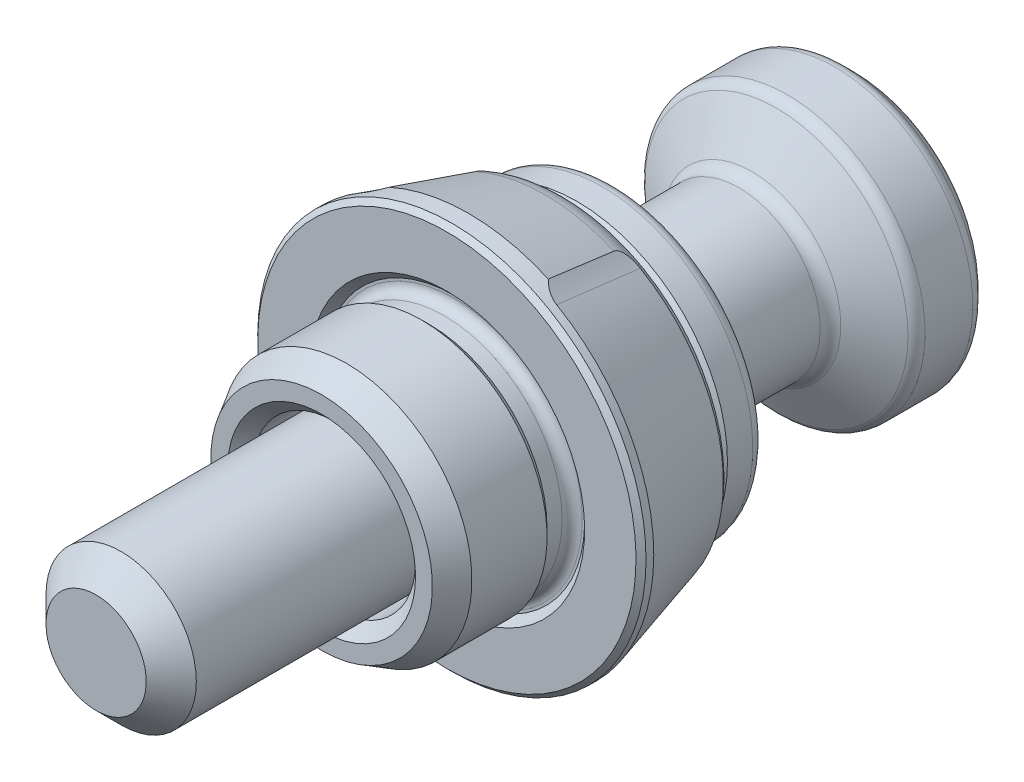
ISO-10303-21;
HEADER;
FILE_DESCRIPTION(('STEP AP214'),'2;1');
FILE_NAME('part.step','',(''),(''),'','','');
FILE_SCHEMA(('AUTOMOTIVE_DESIGN { 1 0 10303 214 1 1 1 1 }'));
ENDSEC;
DATA;
#1=APPLICATION_CONTEXT('core data for automotive mechanical design processes');
#2=APPLICATION_PROTOCOL_DEFINITION('international standard','automotive_design',2000,#1);
#3=PRODUCT_CONTEXT('',#1,'mechanical');
#4=PRODUCT('Part','Part','',(#3));
#5=PRODUCT_RELATED_PRODUCT_CATEGORY('part','',(#4));
#6=PRODUCT_DEFINITION_FORMATION('','',#4);
#7=PRODUCT_DEFINITION_CONTEXT('part definition',#1,'design');
#8=PRODUCT_DEFINITION('design','',#6,#7);
#9=PRODUCT_DEFINITION_SHAPE('','',#8);
#10=(LENGTH_UNIT() NAMED_UNIT(*) SI_UNIT(.MILLI.,.METRE.));
#11=(NAMED_UNIT(*) PLANE_ANGLE_UNIT() SI_UNIT($,.RADIAN.));
#12=(NAMED_UNIT(*) SI_UNIT($,.STERADIAN.) SOLID_ANGLE_UNIT());
#13=UNCERTAINTY_MEASURE_WITH_UNIT(LENGTH_MEASURE(1.E-05),#10,'distance_accuracy_value','');
#14=(GEOMETRIC_REPRESENTATION_CONTEXT(3) GLOBAL_UNCERTAINTY_ASSIGNED_CONTEXT((#13)) GLOBAL_UNIT_ASSIGNED_CONTEXT((#10,
#11,#12)) REPRESENTATION_CONTEXT('',''));
#15=CARTESIAN_POINT('',(0.,0.,0.));
#16=DIRECTION('',(0.,0.,1.));
#17=DIRECTION('',(1.,0.,0.));
#18=AXIS2_PLACEMENT_3D('',#15,#16,#17);
#19=CARTESIAN_POINT('',(-4.,0.,-5.));
#20=DIRECTION('',(0.,0.,1.));
#21=DIRECTION('',(0.,1.,0.));
#22=AXIS2_PLACEMENT_3D('',#19,#20,#21);
#23=PLANE('',#22);
#24=CARTESIAN_POINT('',(0.,0.,-5.));
#25=DIRECTION('',(0.,0.,1.));
#26=DIRECTION('',(0.,1.,0.));
#27=AXIS2_PLACEMENT_3D('',#24,#25,#26);
#28=CIRCLE('',#27,5.8);
#29=CARTESIAN_POINT('',(0.,5.8,-5.));
#30=VERTEX_POINT('',#29);
#31=EDGE_CURVE('E885',#30,#30,#28,.T.);
#32=ORIENTED_EDGE('',*,*,#31,.T.);
#33=EDGE_LOOP('',(#32));
#34=FACE_BOUND('',#33,.T.);
#35=CARTESIAN_POINT('',(0.,0.,-5.));
#36=DIRECTION('',(0.,0.,-1.));
#37=DIRECTION('',(0.,1.,0.));
#38=AXIS2_PLACEMENT_3D('',#35,#36,#37);
#39=CIRCLE('',#38,5.43594199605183);
#40=CARTESIAN_POINT('',(0.,5.43594199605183,-5.));
#41=VERTEX_POINT('',#40);
#42=EDGE_CURVE('E174',#41,#41,#39,.T.);
#43=ORIENTED_EDGE('',*,*,#42,.T.);
#44=EDGE_LOOP('',(#43));
#45=FACE_BOUND('',#44,.T.);
#46=ADVANCED_FACE('F14',(#34,#45),#23,.T.);
#47=CARTESIAN_POINT('',(0.,0.,-5.2));
#48=DIRECTION('',(0.,0.,-1.));
#49=DIRECTION('',(0.,-1.,0.));
#50=AXIS2_PLACEMENT_3D('',#47,#48,#49);
#51=CONICAL_SURFACE('',#50,6.,0.785398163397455);
#52=ORIENTED_EDGE('',*,*,#31,.F.);
#53=EDGE_LOOP('',(#52));
#54=FACE_BOUND('',#53,.T.);
#55=CARTESIAN_POINT('',(0.,0.,-5.2));
#56=DIRECTION('',(0.,0.,1.));
#57=DIRECTION('',(0.,1.,0.));
#58=AXIS2_PLACEMENT_3D('',#55,#56,#57);
#59=CIRCLE('',#58,6.);
#60=CARTESIAN_POINT('',(0.,6.,-5.2));
#61=VERTEX_POINT('',#60);
#62=EDGE_CURVE('E883',#61,#61,#59,.F.);
#63=ORIENTED_EDGE('',*,*,#62,.F.);
#64=EDGE_LOOP('',(#63));
#65=FACE_BOUND('',#64,.T.);
#66=ADVANCED_FACE('F347',(#54,#65),#51,.T.);
#67=CARTESIAN_POINT('',(0.,0.,-5.));
#68=DIRECTION('',(0.,0.,-1.));
#69=DIRECTION('',(0.,-1.,0.));
#70=AXIS2_PLACEMENT_3D('',#67,#68,#69);
#71=CYLINDRICAL_SURFACE('',#70,6.);
#72=CARTESIAN_POINT('',(0.,0.,-6.21132486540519));
#73=DIRECTION('',(0.,0.,-1.));
#74=DIRECTION('',(0.,-1.,0.));
#75=AXIS2_PLACEMENT_3D('',#72,#73,#74);
#76=CIRCLE('',#75,6.);
#77=CARTESIAN_POINT('',(0.,-6.,-6.21132486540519));
#78=VERTEX_POINT('',#77);
#79=EDGE_CURVE('E393',#78,#78,#76,.F.);
#80=ORIENTED_EDGE('',*,*,#79,.T.);
#81=EDGE_LOOP('',(#80));
#82=FACE_BOUND('',#81,.T.);
#83=ORIENTED_EDGE('',*,*,#62,.T.);
#84=EDGE_LOOP('',(#83));
#85=FACE_BOUND('',#84,.T.);
#86=ADVANCED_FACE('F343',(#82,#85),#71,.T.);
#87=CARTESIAN_POINT('',(0.,0.,-6.21132486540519));
#88=DIRECTION('',(0.,0.,-1.));
#89=DIRECTION('',(0.,-1.,0.));
#90=AXIS2_PLACEMENT_3D('',#87,#88,#89);
#91=TOROIDAL_SURFACE('',#90,5.5,0.5);
#92=CARTESIAN_POINT('',(0.,0.,-6.64433756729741));
#93=DIRECTION('',(0.,0.,-1.));
#94=DIRECTION('',(0.,-1.,0.));
#95=AXIS2_PLACEMENT_3D('',#92,#93,#94);
#96=CIRCLE('',#95,5.75);
#97=CARTESIAN_POINT('',(0.,-5.75,-6.64433756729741));
#98=VERTEX_POINT('',#97);
#99=EDGE_CURVE('E389',#98,#98,#96,.T.);
#100=ORIENTED_EDGE('',*,*,#99,.F.);
#101=EDGE_LOOP('',(#100));
#102=FACE_BOUND('',#101,.T.);
#103=ORIENTED_EDGE('',*,*,#79,.F.);
#104=EDGE_LOOP('',(#103));
#105=FACE_BOUND('',#104,.T.);
#106=ADVANCED_FACE('F346',(#102,#105),#91,.T.);
#107=CARTESIAN_POINT('',(0.,0.,-6.5));
#108=DIRECTION('',(0.,0.,1.));
#109=DIRECTION('',(0.,1.,0.));
#110=AXIS2_PLACEMENT_3D('',#107,#108,#109);
#111=CONICAL_SURFACE('',#110,6.,1.0471975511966);
#112=ORIENTED_EDGE('',*,*,#99,.T.);
#113=EDGE_LOOP('',(#112));
#114=FACE_BOUND('',#113,.T.);
#115=CARTESIAN_POINT('',(0.,0.,-7.91450815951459));
#116=DIRECTION('',(0.,0.,1.));
#117=DIRECTION('',(0.,1.,0.));
#118=AXIS2_PLACEMENT_3D('',#115,#116,#117);
#119=CIRCLE('',#118,3.55);
#120=CARTESIAN_POINT('',(0.,3.55,-7.91450815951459));
#121=VERTEX_POINT('',#120);
#122=EDGE_CURVE('E857',#121,#121,#119,.T.);
#123=ORIENTED_EDGE('',*,*,#122,.T.);
#124=EDGE_LOOP('',(#123));
#125=FACE_BOUND('',#124,.T.);
#126=ADVANCED_FACE('F337',(#114,#125),#111,.T.);
#127=CARTESIAN_POINT('',(0.,0.,-8.43412340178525));
#128=DIRECTION('',(0.,0.,1.));
#129=DIRECTION('',(0.,1.,0.));
#130=AXIS2_PLACEMENT_3D('',#127,#128,#129);
#131=TOROIDAL_SURFACE('',#130,3.85,0.6);
#132=CARTESIAN_POINT('',(0.,0.,-8.43412340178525));
#133=DIRECTION('',(0.,0.,1.));
#134=DIRECTION('',(0.,1.,0.));
#135=AXIS2_PLACEMENT_3D('',#132,#133,#134);
#136=CIRCLE('',#135,3.25);
#137=CARTESIAN_POINT('',(0.,3.25,-8.43412340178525));
#138=VERTEX_POINT('',#137);
#139=EDGE_CURVE('E889',#138,#138,#136,.F.);
#140=ORIENTED_EDGE('',*,*,#139,.F.);
#141=EDGE_LOOP('',(#140));
#142=FACE_BOUND('',#141,.T.);
#143=ORIENTED_EDGE('',*,*,#122,.F.);
#144=EDGE_LOOP('',(#143));
#145=FACE_BOUND('',#144,.T.);
#146=ADVANCED_FACE('F361',(#142,#145),#131,.F.);
#147=CARTESIAN_POINT('',(0.,0.,-5.));
#148=DIRECTION('',(0.,0.,1.));
#149=DIRECTION('',(0.,1.,0.));
#150=AXIS2_PLACEMENT_3D('',#147,#148,#149);
#151=CYLINDRICAL_SURFACE('',#150,3.25);
#152=CARTESIAN_POINT('',(0.,0.,-11.6535898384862));
#153=DIRECTION('',(0.,0.,1.));
#154=DIRECTION('',(0.,1.,0.));
#155=AXIS2_PLACEMENT_3D('',#152,#153,#154);
#156=CIRCLE('',#155,3.25);
#157=CARTESIAN_POINT('',(0.,3.25,-11.6535898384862));
#158=VERTEX_POINT('',#157);
#159=EDGE_CURVE('E866',#158,#158,#156,.T.);
#160=ORIENTED_EDGE('',*,*,#159,.T.);
#161=EDGE_LOOP('',(#160));
#162=FACE_BOUND('',#161,.T.);
#163=ORIENTED_EDGE('',*,*,#139,.T.);
#164=EDGE_LOOP('',(#163));
#165=FACE_BOUND('',#164,.T.);
#166=ADVANCED_FACE('F359',(#162,#165),#151,.T.);
#167=CARTESIAN_POINT('',(0.,0.,-11.6535898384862));
#168=DIRECTION('',(0.,0.,1.));
#169=DIRECTION('',(0.,1.,0.));
#170=AXIS2_PLACEMENT_3D('',#167,#168,#169);
#171=TOROIDAL_SURFACE('',#170,3.85,0.6);
#172=CARTESIAN_POINT('',(0.,0.,-12.1732050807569));
#173=DIRECTION('',(0.,0.,-1.));
#174=DIRECTION('',(0.,-1.,0.));
#175=AXIS2_PLACEMENT_3D('',#172,#173,#174);
#176=CIRCLE('',#175,3.55);
#177=CARTESIAN_POINT('',(0.,-3.55,-12.1732050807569));
#178=VERTEX_POINT('',#177);
#179=EDGE_CURVE('E860',#178,#178,#176,.T.);
#180=ORIENTED_EDGE('',*,*,#179,.F.);
#181=EDGE_LOOP('',(#180));
#182=FACE_BOUND('',#181,.T.);
#183=ORIENTED_EDGE('',*,*,#159,.F.);
#184=EDGE_LOOP('',(#183));
#185=FACE_BOUND('',#184,.T.);
#186=ADVANCED_FACE('F356',(#182,#185),#171,.F.);
#187=CARTESIAN_POINT('',(0.,0.,-12.));
#188=DIRECTION('',(0.,0.,-1.));
#189=DIRECTION('',(0.,-1.,0.));
#190=AXIS2_PLACEMENT_3D('',#187,#188,#189);
#191=CONICAL_SURFACE('',#190,3.25,1.0471975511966);
#192=CARTESIAN_POINT('',(0.,0.,-13.1547005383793));
#193=DIRECTION('',(0.,0.,1.));
#194=DIRECTION('',(0.,1.,0.));
#195=AXIS2_PLACEMENT_3D('',#192,#193,#194);
#196=CIRCLE('',#195,5.25);
#197=CARTESIAN_POINT('',(0.,5.25,-13.1547005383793));
#198=VERTEX_POINT('',#197);
#199=EDGE_CURVE('E875',#198,#198,#196,.T.);
#200=ORIENTED_EDGE('',*,*,#199,.T.);
#201=EDGE_LOOP('',(#200));
#202=FACE_BOUND('',#201,.T.);
#203=ORIENTED_EDGE('',*,*,#179,.T.);
#204=EDGE_LOOP('',(#203));
#205=FACE_BOUND('',#204,.T.);
#206=ADVANCED_FACE('F355',(#202,#205),#191,.T.);
#207=CARTESIAN_POINT('',(0.,0.,-13.5877132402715));
#208=DIRECTION('',(0.,0.,-1.));
#209=DIRECTION('',(0.,-1.,0.));
#210=AXIS2_PLACEMENT_3D('',#207,#208,#209);
#211=TOROIDAL_SURFACE('',#210,5.,0.5);
#212=CARTESIAN_POINT('',(0.,0.,-13.5877132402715));
#213=DIRECTION('',(0.,0.,-1.));
#214=DIRECTION('',(0.,-1.,0.));
#215=AXIS2_PLACEMENT_3D('',#212,#213,#214);
#216=CIRCLE('',#215,5.5);
#217=CARTESIAN_POINT('',(0.,-5.5,-13.5877132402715));
#218=VERTEX_POINT('',#217);
#219=EDGE_CURVE('E859',#218,#218,#216,.T.);
#220=ORIENTED_EDGE('',*,*,#219,.F.);
#221=EDGE_LOOP('',(#220));
#222=FACE_BOUND('',#221,.T.);
#223=ORIENTED_EDGE('',*,*,#199,.F.);
#224=EDGE_LOOP('',(#223));
#225=FACE_BOUND('',#224,.T.);
#226=ADVANCED_FACE('F369',(#222,#225),#211,.T.);
#227=CARTESIAN_POINT('',(0.,0.,-5.));
#228=DIRECTION('',(0.,0.,1.));
#229=DIRECTION('',(0.,1.,0.));
#230=AXIS2_PLACEMENT_3D('',#227,#228,#229);
#231=CYLINDRICAL_SURFACE('',#230,5.5);
#232=CARTESIAN_POINT('',(0.,0.,-15.4928932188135));
#233=DIRECTION('',(0.,0.,-1.));
#234=DIRECTION('',(0.,-1.,0.));
#235=AXIS2_PLACEMENT_3D('',#232,#233,#234);
#236=CIRCLE('',#235,5.5);
#237=CARTESIAN_POINT('',(0.,-5.5,-15.4928932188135));
#238=VERTEX_POINT('',#237);
#239=EDGE_CURVE('E863',#238,#238,#236,.F.);
#240=ORIENTED_EDGE('',*,*,#239,.T.);
#241=EDGE_LOOP('',(#240));
#242=FACE_BOUND('',#241,.T.);
#243=ORIENTED_EDGE('',*,*,#219,.T.);
#244=EDGE_LOOP('',(#243));
#245=FACE_BOUND('',#244,.T.);
#246=ADVANCED_FACE('F342',(#242,#245),#231,.T.);
#247=CARTESIAN_POINT('',(0.,0.,-15.4928932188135));
#248=DIRECTION('',(0.,0.,-1.));
#249=DIRECTION('',(0.,-1.,0.));
#250=AXIS2_PLACEMENT_3D('',#247,#248,#249);
#251=TOROIDAL_SURFACE('',#250,5.,0.5);
#252=CARTESIAN_POINT('',(0.,0.,-15.8464466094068));
#253=DIRECTION('',(0.,0.,-1.));
#254=DIRECTION('',(0.,-1.,0.));
#255=AXIS2_PLACEMENT_3D('',#252,#253,#254);
#256=CIRCLE('',#255,5.35355339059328);
#257=CARTESIAN_POINT('',(0.,-5.35355339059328,-15.8464466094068));
#258=VERTEX_POINT('',#257);
#259=EDGE_CURVE('E872',#258,#258,#256,.T.);
#260=ORIENTED_EDGE('',*,*,#259,.F.);
#261=EDGE_LOOP('',(#260));
#262=FACE_BOUND('',#261,.T.);
#263=ORIENTED_EDGE('',*,*,#239,.F.);
#264=EDGE_LOOP('',(#263));
#265=FACE_BOUND('',#264,.T.);
#266=ADVANCED_FACE('F365',(#262,#265),#251,.T.);
#267=CARTESIAN_POINT('',(0.,0.,-15.7));
#268=DIRECTION('',(0.,0.,1.));
#269=DIRECTION('',(0.,1.,0.));
#270=AXIS2_PLACEMENT_3D('',#267,#268,#269);
#271=CONICAL_SURFACE('',#270,5.5,0.785398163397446);
#272=CARTESIAN_POINT('',(0.,0.,-16.2071067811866));
#273=DIRECTION('',(0.,0.,-1.));
#274=DIRECTION('',(0.,-1.,0.));
#275=AXIS2_PLACEMENT_3D('',#272,#273,#274);
#276=CIRCLE('',#275,4.99289321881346);
#277=CARTESIAN_POINT('',(0.,-4.99289321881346,-16.2071067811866));
#278=VERTEX_POINT('',#277);
#279=EDGE_CURVE('E388',#278,#278,#276,.F.);
#280=ORIENTED_EDGE('',*,*,#279,.T.);
#281=EDGE_LOOP('',(#280));
#282=FACE_BOUND('',#281,.T.);
#283=ORIENTED_EDGE('',*,*,#259,.T.);
#284=EDGE_LOOP('',(#283));
#285=FACE_BOUND('',#284,.T.);
#286=ADVANCED_FACE('F244',(#282,#285),#271,.T.);
#287=CARTESIAN_POINT('',(0.,0.,-15.5));
#288=DIRECTION('',(0.,0.,-1.));
#289=DIRECTION('',(0.,-1.,0.));
#290=AXIS2_PLACEMENT_3D('',#287,#288,#289);
#291=TOROIDAL_SURFACE('',#290,4.28578643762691,1.);
#292=CARTESIAN_POINT('',(0.,0.,-16.5));
#293=DIRECTION('',(0.,0.,-1.));
#294=DIRECTION('',(0.,-1.,0.));
#295=AXIS2_PLACEMENT_3D('',#292,#293,#294);
#296=CIRCLE('',#295,4.28578643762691);
#297=CARTESIAN_POINT('',(0.,-4.28578643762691,-16.5));
#298=VERTEX_POINT('',#297);
#299=EDGE_CURVE('E385',#298,#298,#296,.T.);
#300=ORIENTED_EDGE('',*,*,#299,.F.);
#301=EDGE_LOOP('',(#300));
#302=FACE_BOUND('',#301,.T.);
#303=ORIENTED_EDGE('',*,*,#279,.F.);
#304=EDGE_LOOP('',(#303));
#305=FACE_BOUND('',#304,.T.);
#306=ADVANCED_FACE('F241',(#302,#305),#291,.T.);
#307=CARTESIAN_POINT('',(-6.,0.,-16.5));
#308=DIRECTION('',(0.,0.,-1.));
#309=DIRECTION('',(0.,-1.,0.));
#310=AXIS2_PLACEMENT_3D('',#307,#308,#309);
#311=PLANE('',#310);
#312=ORIENTED_EDGE('',*,*,#299,.T.);
#313=EDGE_LOOP('',(#312));
#314=FACE_BOUND('',#313,.T.);
#315=CARTESIAN_POINT('',(0.,0.,-16.5));
#316=DIRECTION('',(0.,0.,1.));
#317=DIRECTION('',(0.,1.,0.));
#318=AXIS2_PLACEMENT_3D('',#315,#316,#317);
#319=CIRCLE('',#318,2.);
#320=CARTESIAN_POINT('',(0.,2.,-16.5));
#321=VERTEX_POINT('',#320);
#322=EDGE_CURVE('E209',#321,#321,#319,.T.);
#323=ORIENTED_EDGE('',*,*,#322,.T.);
#324=EDGE_LOOP('',(#323));
#325=FACE_BOUND('',#324,.T.);
#326=ADVANCED_FACE('F239',(#314,#325),#311,.T.);
#327=CARTESIAN_POINT('',(0.,0.,-16.5));
#328=DIRECTION('',(0.,0.,-1.));
#329=DIRECTION('',(0.,-1.,0.));
#330=AXIS2_PLACEMENT_3D('',#327,#328,#329);
#331=CONICAL_SURFACE('',#330,2.,1.0471975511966);
#332=ORIENTED_EDGE('',*,*,#322,.F.);
#333=EDGE_LOOP('',(#332));
#334=FACE_BOUND('',#333,.T.);
#335=CARTESIAN_POINT('',(-0.8659099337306,1.5002,-16.3453661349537));
#336=CARTESIAN_POINT('',(-0.903968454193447,1.43428070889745,-16.3233823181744));
#337=CARTESIAN_POINT('',(-0.942355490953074,1.36779241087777,-16.303388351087));
#338=CARTESIAN_POINT('',(-1.01979436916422,1.23366433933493,-16.2684875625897));
#339=CARTESIAN_POINT('',(-1.05884758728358,1.16602218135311,-16.2535930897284));
#340=CARTESIAN_POINT('',(-1.13646999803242,1.03157622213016,-16.2304061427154));
#341=CARTESIAN_POINT('',(-1.17502724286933,0.964793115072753,-16.221959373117));
#342=CARTESIAN_POINT('',(-1.25232329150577,0.830912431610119,-16.211873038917));
#343=CARTESIAN_POINT('',(-1.29106181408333,0.763815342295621,-16.2102251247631));
#344=CARTESIAN_POINT('',(-1.363455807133,0.638425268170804,-16.2136410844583));
#345=CARTESIAN_POINT('',(-1.39712207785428,0.580113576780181,-16.2178662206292));
#346=CARTESIAN_POINT('',(-1.46423526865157,0.463870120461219,-16.2312612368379));
#347=CARTESIAN_POINT('',(-1.49768195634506,0.405938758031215,-16.240435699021));
#348=CARTESIAN_POINT('',(-1.56493368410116,0.289455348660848,-16.2633726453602));
#349=CARTESIAN_POINT('',(-1.59873020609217,0.230918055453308,-16.2772324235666));
#350=CARTESIAN_POINT('',(-1.6658189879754,0.114716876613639,-16.3086892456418));
#351=CARTESIAN_POINT('',(-1.699112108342,0.0570515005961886,-16.3262788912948));
#352=CARTESIAN_POINT('',(-1.73216627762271,-0.000200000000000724,-16.3453661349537));
#353=B_SPLINE_CURVE_WITH_KNOTS('',3,(#335,#336,#337,#338,#339,#340,#341,#342,#343,#344,#345,
#346,#347,#348,#349,#350,#351,#352),.UNSPECIFIED.,.F.,.F.,(4,2,2,2,2,2,2,2,4),(0.,
0.237777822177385,0.476127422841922,0.708577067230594,0.940741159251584,1.14294352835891,
1.34533342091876,1.55221450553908,1.75868901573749),.UNSPECIFIED.);
#354=CARTESIAN_POINT('',(-0.866025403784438,1.5,-16.3452994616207));
#355=VERTEX_POINT('',#354);
#356=CARTESIAN_POINT('',(-1.73205080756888,0.,-16.3452994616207));
#357=VERTEX_POINT('',#356);
#358=EDGE_CURVE('E94',#355,#357,#353,.T.);
#359=ORIENTED_EDGE('',*,*,#358,.T.);
#360=CARTESIAN_POINT('',(-1.73216627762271,0.000199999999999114,-16.3453661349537));
#361=CARTESIAN_POINT('',(-1.69410775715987,-0.0657192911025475,-16.3233823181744));
#362=CARTESIAN_POINT('',(-1.65572072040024,-0.132207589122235,-16.303388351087));
#363=CARTESIAN_POINT('',(-1.5782818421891,-0.266335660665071,-16.2684875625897));
#364=CARTESIAN_POINT('',(-1.53922862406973,-0.333977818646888,-16.2535930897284));
#365=CARTESIAN_POINT('',(-1.4616062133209,-0.468423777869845,-16.2304061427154));
#366=CARTESIAN_POINT('',(-1.42304896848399,-0.53520688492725,-16.221959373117));
#367=CARTESIAN_POINT('',(-1.34575291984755,-0.669087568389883,-16.211873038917));
#368=CARTESIAN_POINT('',(-1.30701439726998,-0.736184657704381,-16.2102251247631));
#369=CARTESIAN_POINT('',(-1.23462040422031,-0.861574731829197,-16.2136410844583));
#370=CARTESIAN_POINT('',(-1.20095413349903,-0.919886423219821,-16.2178662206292));
#371=CARTESIAN_POINT('',(-1.13384094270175,-1.03612987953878,-16.2312612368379));
#372=CARTESIAN_POINT('',(-1.10039425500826,-1.09406124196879,-16.240435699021));
#373=CARTESIAN_POINT('',(-1.03314252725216,-1.21054465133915,-16.2633726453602));
#374=CARTESIAN_POINT('',(-0.999346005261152,-1.26908194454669,-16.2772324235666));
#375=CARTESIAN_POINT('',(-0.932257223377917,-1.38528312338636,-16.3086892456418));
#376=CARTESIAN_POINT('',(-0.898964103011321,-1.44294849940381,-16.3262788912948));
#377=CARTESIAN_POINT('',(-0.865909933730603,-1.5002,-16.3453661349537));
#378=B_SPLINE_CURVE_WITH_KNOTS('',3,(#360,#361,#362,#363,#364,#365,#366,#367,#368,#369,#370,
#371,#372,#373,#374,#375,#376,#377),.UNSPECIFIED.,.F.,.F.,(4,2,2,2,2,2,2,2,4),(0.,
0.237777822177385,0.476127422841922,0.708577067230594,0.940741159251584,1.14294352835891,
1.34533342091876,1.55221450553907,1.75868901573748),.UNSPECIFIED.);
#379=CARTESIAN_POINT('',(-0.86602540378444,-1.5,-16.3452994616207));
#380=VERTEX_POINT('',#379);
#381=EDGE_CURVE('E214',#357,#380,#378,.T.);
#382=ORIENTED_EDGE('',*,*,#381,.T.);
#383=CARTESIAN_POINT('',(2.29543900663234,-1.5,-16.9284440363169));
#384=CARTESIAN_POINT('',(2.23016907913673,-1.5,-16.8969074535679));
#385=CARTESIAN_POINT('',(2.16474594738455,-1.5,-16.8656823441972));
#386=CARTESIAN_POINT('',(2.03351166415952,-1.5,-16.8040309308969));
#387=CARTESIAN_POINT('',(1.96770045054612,-1.5,-16.773604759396));
#388=CARTESIAN_POINT('',(1.83525433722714,-1.5,-16.7135673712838));
#389=CARTESIAN_POINT('',(1.76861688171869,-1.5,-16.6839617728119));
#390=CARTESIAN_POINT('',(1.63480095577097,-1.5,-16.6260043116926));
#391=CARTESIAN_POINT('',(1.56762251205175,-1.5,-16.5976523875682));
#392=CARTESIAN_POINT('',(1.43058681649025,-1.5,-16.5417052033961));
#393=CARTESIAN_POINT('',(1.36070972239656,-1.5,-16.5141582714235));
#394=CARTESIAN_POINT('',(1.22012618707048,-1.5,-16.4612246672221));
#395=CARTESIAN_POINT('',(1.14941964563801,-1.5,-16.4358382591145));
#396=CARTESIAN_POINT('',(1.00721111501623,-1.5,-16.3879160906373));
#397=CARTESIAN_POINT('',(0.935711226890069,-1.5,-16.3653741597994));
#398=CARTESIAN_POINT('',(0.79168072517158,-1.5,-16.3238812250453));
#399=CARTESIAN_POINT('',(0.71915036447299,-1.5,-16.3049293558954));
#400=CARTESIAN_POINT('',(0.573415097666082,-1.5,-16.2716463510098));
#401=CARTESIAN_POINT('',(0.50021567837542,-1.5,-16.2572916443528));
#402=CARTESIAN_POINT('',(0.352940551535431,-1.5,-16.234036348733));
#403=CARTESIAN_POINT('',(0.278864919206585,-1.5,-16.2251352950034));
#404=CARTESIAN_POINT('',(0.131159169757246,-1.5,-16.2136168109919));
#405=CARTESIAN_POINT('',(0.0575353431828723,-1.5,-16.2109210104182));
#406=CARTESIAN_POINT('',(-0.0896707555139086,-1.5,-16.2118280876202));
#407=CARTESIAN_POINT('',(-0.163253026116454,-1.5,-16.2154311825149));
#408=CARTESIAN_POINT('',(-0.341649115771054,-1.5,-16.2314857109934));
#409=CARTESIAN_POINT('',(-0.446180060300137,-1.5,-16.2470947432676));
#410=CARTESIAN_POINT('',(-0.653280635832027,-1.5,-16.2882095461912));
#411=CARTESIAN_POINT('',(-0.755848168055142,-1.5,-16.3137253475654));
#412=CARTESIAN_POINT('',(-0.961126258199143,-1.5,-16.3725352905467));
#413=CARTESIAN_POINT('',(-1.06378994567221,-1.5,-16.4059887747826));
#414=CARTESIAN_POINT('',(-1.26721758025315,-1.5,-16.4780546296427));
#415=CARTESIAN_POINT('',(-1.36798209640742,-1.5,-16.516665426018));
#416=CARTESIAN_POINT('',(-1.60568963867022,-1.5,-16.6126473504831));
#417=CARTESIAN_POINT('',(-1.74198279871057,-1.5,-16.671611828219));
#418=CARTESIAN_POINT('',(-2.0126915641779,-1.5,-16.7937291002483));
#419=CARTESIAN_POINT('',(-2.1471066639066,-1.5,-16.8568829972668));
#420=CARTESIAN_POINT('',(-2.41474388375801,-1.5,-16.9859892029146));
#421=CARTESIAN_POINT('',(-2.54796469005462,-1.5,-17.0519442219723));
#422=CARTESIAN_POINT('',(-2.81346836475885,-1.5,-17.1857175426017));
#423=CARTESIAN_POINT('',(-2.94575120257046,-1.5,-17.253535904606));
#424=CARTESIAN_POINT('',(-3.19854913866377,-1.5,-17.3847374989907));
#425=CARTESIAN_POINT('',(-3.31911936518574,-1.5,-17.4480147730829));
#426=CARTESIAN_POINT('',(-3.55982498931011,-1.5,-17.5753998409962));
#427=CARTESIAN_POINT('',(-3.67996037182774,-1.5,-17.6395076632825));
#428=CARTESIAN_POINT('',(-3.9196048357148,-1.5,-17.7682016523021));
#429=CARTESIAN_POINT('',(-4.03911472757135,-1.5,-17.8327863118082));
#430=CARTESIAN_POINT('',(-4.2778570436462,-1.5,-17.9624516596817));
#431=CARTESIAN_POINT('',(-4.39708948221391,-1.5,-18.0275323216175));
#432=CARTESIAN_POINT('',(-4.51621992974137,-1.5,-18.0927978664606));
#433=B_SPLINE_CURVE_WITH_KNOTS('',3,(#383,#384,#385,#386,#387,#388,#389,#390,#391,#392,#393,
#394,#395,#396,#397,#398,#399,#400,#401,#402,#403,#404,#405,#406,#407,#408,#409,#410,#411,#412,
#413,#414,#415,#416,#417,#418,#419,#420,#421,#422,#423,#424,#425,#426,#427,#428,#429,#430,#431,
#432),.UNSPECIFIED.,.F.,.F.,(4,2,2,2,2,2,2,2,2,2,2,2,2,2,2,2,2,2,2,2,2,2,2,2,4),(0.,
0.217471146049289,0.434978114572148,0.653721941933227,0.872455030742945,1.09776002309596,
1.32309251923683,1.54792748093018,1.77270818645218,1.99631720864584,2.21990717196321,
2.440657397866,2.66141523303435,2.97783093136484,3.29456784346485,3.61830004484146,
3.94193365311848,4.38731314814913,4.8328103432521,5.27874889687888,5.72470193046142,
6.13319601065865,6.54170412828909,6.94923706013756,7.35674842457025),.UNSPECIFIED.);
#434=CARTESIAN_POINT('',(0.866025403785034,-1.5,-16.3452994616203));
#435=VERTEX_POINT('',#434);
#436=EDGE_CURVE('E222',#380,#435,#433,.F.);
#437=ORIENTED_EDGE('',*,*,#436,.T.);
#438=CARTESIAN_POINT('',(0.865909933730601,-1.5002,-16.3453661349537));
#439=CARTESIAN_POINT('',(0.903968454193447,-1.43428070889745,-16.3233823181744));
#440=CARTESIAN_POINT('',(0.942355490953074,-1.36779241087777,-16.303388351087));
#441=CARTESIAN_POINT('',(1.01979436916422,-1.23366433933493,-16.2684875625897));
#442=CARTESIAN_POINT('',(1.05884758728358,-1.16602218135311,-16.2535930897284));
#443=CARTESIAN_POINT('',(1.13646999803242,-1.03157622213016,-16.2304061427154));
#444=CARTESIAN_POINT('',(1.17502724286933,-0.964793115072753,-16.221959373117));
#445=CARTESIAN_POINT('',(1.25232329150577,-0.83091243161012,-16.211873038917));
#446=CARTESIAN_POINT('',(1.29106181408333,-0.763815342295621,-16.2102251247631));
#447=CARTESIAN_POINT('',(1.363455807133,-0.638425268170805,-16.2136410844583));
#448=CARTESIAN_POINT('',(1.39712207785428,-0.580113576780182,-16.2178662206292));
#449=CARTESIAN_POINT('',(1.46423526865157,-0.46387012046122,-16.2312612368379));
#450=CARTESIAN_POINT('',(1.49768195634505,-0.405938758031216,-16.240435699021));
#451=CARTESIAN_POINT('',(1.56493368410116,-0.289455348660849,-16.2633726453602));
#452=CARTESIAN_POINT('',(1.59873020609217,-0.230918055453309,-16.2772324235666));
#453=CARTESIAN_POINT('',(1.6658189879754,-0.114716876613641,-16.3086892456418));
#454=CARTESIAN_POINT('',(1.699112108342,-0.0570515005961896,-16.3262788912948));
#455=CARTESIAN_POINT('',(1.73216627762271,0.000200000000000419,-16.3453661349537));
#456=B_SPLINE_CURVE_WITH_KNOTS('',3,(#438,#439,#440,#441,#442,#443,#444,#445,#446,#447,#448,
#449,#450,#451,#452,#453,#454,#455),.UNSPECIFIED.,.F.,.F.,(4,2,2,2,2,2,2,2,4),(0.,
0.237777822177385,0.476127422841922,0.708577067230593,0.940741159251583,1.14294352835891,
1.34533342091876,1.55221450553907,1.75868901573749),.UNSPECIFIED.);
#457=CARTESIAN_POINT('',(1.73205080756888,0.,-16.3452994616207));
#458=VERTEX_POINT('',#457);
#459=EDGE_CURVE('E252',#435,#458,#456,.T.);
#460=ORIENTED_EDGE('',*,*,#459,.T.);
#461=CARTESIAN_POINT('',(1.73216627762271,-0.000199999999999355,-16.3453661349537));
#462=CARTESIAN_POINT('',(1.69410775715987,0.0657192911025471,-16.3233823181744));
#463=CARTESIAN_POINT('',(1.65572072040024,0.132207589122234,-16.303388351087));
#464=CARTESIAN_POINT('',(1.5782818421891,0.26633566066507,-16.2684875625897));
#465=CARTESIAN_POINT('',(1.53922862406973,0.333977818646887,-16.2535930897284));
#466=CARTESIAN_POINT('',(1.4616062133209,0.468423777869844,-16.2304061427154));
#467=CARTESIAN_POINT('',(1.42304896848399,0.535206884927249,-16.221959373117));
#468=CARTESIAN_POINT('',(1.34575291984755,0.669087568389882,-16.211873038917));
#469=CARTESIAN_POINT('',(1.30701439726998,0.73618465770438,-16.2102251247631));
#470=CARTESIAN_POINT('',(1.23462040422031,0.861574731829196,-16.2136410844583));
#471=CARTESIAN_POINT('',(1.20095413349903,0.91988642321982,-16.2178662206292));
#472=CARTESIAN_POINT('',(1.13384094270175,1.03612987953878,-16.2312612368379));
#473=CARTESIAN_POINT('',(1.10039425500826,1.09406124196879,-16.240435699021));
#474=CARTESIAN_POINT('',(1.03314252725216,1.21054465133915,-16.2633726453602));
#475=CARTESIAN_POINT('',(0.99934600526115,1.26908194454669,-16.2772324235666));
#476=CARTESIAN_POINT('',(0.932257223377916,1.38528312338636,-16.3086892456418));
#477=CARTESIAN_POINT('',(0.89896410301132,1.44294849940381,-16.3262788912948));
#478=CARTESIAN_POINT('',(0.865909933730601,1.5002,-16.3453661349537));
#479=B_SPLINE_CURVE_WITH_KNOTS('',3,(#461,#462,#463,#464,#465,#466,#467,#468,#469,#470,#471,
#472,#473,#474,#475,#476,#477,#478),.UNSPECIFIED.,.F.,.F.,(4,2,2,2,2,2,2,2,4),(0.,
0.237777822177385,0.476127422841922,0.708577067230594,0.940741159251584,1.14294352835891,
1.34533342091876,1.55221450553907,1.75868901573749),.UNSPECIFIED.);
#480=CARTESIAN_POINT('',(0.866025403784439,1.5,-16.3452994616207));
#481=VERTEX_POINT('',#480);
#482=EDGE_CURVE('E259',#458,#481,#479,.T.);
#483=ORIENTED_EDGE('',*,*,#482,.T.);
#484=CARTESIAN_POINT('',(2.29543900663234,1.5,-16.9284440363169));
#485=CARTESIAN_POINT('',(2.23016907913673,1.5,-16.8969074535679));
#486=CARTESIAN_POINT('',(2.16474594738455,1.5,-16.8656823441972));
#487=CARTESIAN_POINT('',(2.03351166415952,1.5,-16.8040309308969));
#488=CARTESIAN_POINT('',(1.96770045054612,1.5,-16.773604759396));
#489=CARTESIAN_POINT('',(1.83525433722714,1.5,-16.7135673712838));
#490=CARTESIAN_POINT('',(1.76861688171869,1.5,-16.6839617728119));
#491=CARTESIAN_POINT('',(1.63480095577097,1.5,-16.6260043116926));
#492=CARTESIAN_POINT('',(1.56762251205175,1.5,-16.5976523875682));
#493=CARTESIAN_POINT('',(1.43058681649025,1.5,-16.5417052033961));
#494=CARTESIAN_POINT('',(1.36070972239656,1.5,-16.5141582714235));
#495=CARTESIAN_POINT('',(1.22012618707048,1.5,-16.4612246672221));
#496=CARTESIAN_POINT('',(1.14941964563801,1.5,-16.4358382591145));
#497=CARTESIAN_POINT('',(1.00721111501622,1.5,-16.3879160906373));
#498=CARTESIAN_POINT('',(0.935711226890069,1.5,-16.3653741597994));
#499=CARTESIAN_POINT('',(0.791680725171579,1.5,-16.3238812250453));
#500=CARTESIAN_POINT('',(0.71915036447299,1.5,-16.3049293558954));
#501=CARTESIAN_POINT('',(0.573415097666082,1.5,-16.2716463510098));
#502=CARTESIAN_POINT('',(0.500215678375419,1.5,-16.2572916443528));
#503=CARTESIAN_POINT('',(0.352940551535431,1.5,-16.234036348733));
#504=CARTESIAN_POINT('',(0.278864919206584,1.5,-16.2251352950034));
#505=CARTESIAN_POINT('',(0.131159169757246,1.5,-16.2136168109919));
#506=CARTESIAN_POINT('',(0.0575353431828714,1.5,-16.2109210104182));
#507=CARTESIAN_POINT('',(-0.0896707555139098,1.5,-16.2118280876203));
#508=CARTESIAN_POINT('',(-0.163253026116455,1.5,-16.2154311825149));
#509=CARTESIAN_POINT('',(-0.341649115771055,1.5,-16.2314857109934));
#510=CARTESIAN_POINT('',(-0.446180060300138,1.5,-16.2470947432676));
#511=CARTESIAN_POINT('',(-0.653280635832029,1.5,-16.2882095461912));
#512=CARTESIAN_POINT('',(-0.755848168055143,1.5,-16.3137253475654));
#513=CARTESIAN_POINT('',(-0.961126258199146,1.5,-16.3725352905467));
#514=CARTESIAN_POINT('',(-1.06378994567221,1.5,-16.4059887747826));
#515=CARTESIAN_POINT('',(-1.26721758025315,1.5,-16.4780546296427));
#516=CARTESIAN_POINT('',(-1.36798209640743,1.5,-16.516665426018));
#517=CARTESIAN_POINT('',(-1.60568963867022,1.5,-16.6126473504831));
#518=CARTESIAN_POINT('',(-1.74198279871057,1.5,-16.671611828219));
#519=CARTESIAN_POINT('',(-2.0126915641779,1.5,-16.7937291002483));
#520=CARTESIAN_POINT('',(-2.14710666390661,1.5,-16.8568829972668));
#521=CARTESIAN_POINT('',(-2.41474388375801,1.5,-16.9859892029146));
#522=CARTESIAN_POINT('',(-2.54796469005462,1.5,-17.0519442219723));
#523=CARTESIAN_POINT('',(-2.81346836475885,1.5,-17.1857175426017));
#524=CARTESIAN_POINT('',(-2.94575120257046,1.5,-17.253535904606));
#525=CARTESIAN_POINT('',(-3.19854913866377,1.5,-17.3847374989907));
#526=CARTESIAN_POINT('',(-3.31911936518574,1.5,-17.4480147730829));
#527=CARTESIAN_POINT('',(-3.55982498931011,1.5,-17.5753998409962));
#528=CARTESIAN_POINT('',(-3.67996037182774,1.5,-17.6395076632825));
#529=CARTESIAN_POINT('',(-3.91960483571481,1.5,-17.7682016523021));
#530=CARTESIAN_POINT('',(-4.03911472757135,1.5,-17.8327863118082));
#531=CARTESIAN_POINT('',(-4.2778570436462,1.5,-17.9624516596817));
#532=CARTESIAN_POINT('',(-4.39708948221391,1.5,-18.0275323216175));
#533=CARTESIAN_POINT('',(-4.51621992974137,1.5,-18.0927978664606));
#534=B_SPLINE_CURVE_WITH_KNOTS('',3,(#484,#485,#486,#487,#488,#489,#490,#491,#492,#493,#494,
#495,#496,#497,#498,#499,#500,#501,#502,#503,#504,#505,#506,#507,#508,#509,#510,#511,#512,#513,
#514,#515,#516,#517,#518,#519,#520,#521,#522,#523,#524,#525,#526,#527,#528,#529,#530,#531,#532,
#533),.UNSPECIFIED.,.F.,.F.,(4,2,2,2,2,2,2,2,2,2,2,2,2,2,2,2,2,2,2,2,2,2,2,2,4),(0.,
0.217471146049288,0.434978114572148,0.653721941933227,0.872455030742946,1.09776002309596,
1.32309251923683,1.54792748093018,1.77270818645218,1.99631720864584,2.21990717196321,
2.440657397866,2.66141523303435,2.97783093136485,3.29456784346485,3.61830004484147,
3.94193365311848,4.38731314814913,4.83281034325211,5.27874889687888,5.72470193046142,
6.13319601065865,6.5417041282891,6.94923706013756,7.35674842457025),.UNSPECIFIED.);
#535=EDGE_CURVE('E266',#481,#355,#534,.T.);
#536=ORIENTED_EDGE('',*,*,#535,.T.);
#537=EDGE_LOOP('',(#359,#382,#437,#460,#483,#536));
#538=FACE_BOUND('',#537,.T.);
#539=ADVANCED_FACE('F233',(#334,#538),#331,.F.);
#540=CARTESIAN_POINT('',(-1.73205080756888,0.,-14.));
#541=DIRECTION('',(-0.866025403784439,0.5,0.));
#542=DIRECTION('',(-0.5,-0.866025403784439,0.));
#543=AXIS2_PLACEMENT_3D('',#540,#541,#542);
#544=PLANE('',#543);
#545=ORIENTED_EDGE('',*,*,#358,.F.);
#546=DIRECTION('',(0.,0.,-1.));
#547=VECTOR('',#546,1.);
#548=CARTESIAN_POINT('',(-0.866025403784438,1.5,-14.));
#549=LINE('',#548,#547);
#550=CARTESIAN_POINT('',(-0.866025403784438,1.5,-14.));
#551=VERTEX_POINT('',#550);
#552=EDGE_CURVE('E905',#551,#355,#549,.T.);
#553=ORIENTED_EDGE('',*,*,#552,.F.);
#554=DIRECTION('',(0.5,0.866025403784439,0.));
#555=VECTOR('',#554,1.);
#556=CARTESIAN_POINT('',(-1.73205080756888,0.,-14.));
#557=LINE('',#556,#555);
#558=CARTESIAN_POINT('',(-1.29903810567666,0.75,-14.));
#559=VERTEX_POINT('',#558);
#560=EDGE_CURVE('E934',#559,#551,#557,.T.);
#561=ORIENTED_EDGE('',*,*,#560,.F.);
#562=CARTESIAN_POINT('',(-1.73205080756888,0.,-14.));
#563=VERTEX_POINT('',#562);
#564=EDGE_CURVE('E932',#563,#559,#557,.T.);
#565=ORIENTED_EDGE('',*,*,#564,.F.);
#566=DIRECTION('',(0.,0.,-1.));
#567=VECTOR('',#566,1.);
#568=CARTESIAN_POINT('',(-1.73205080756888,0.,-14.));
#569=LINE('',#568,#567);
#570=EDGE_CURVE('E895',#563,#357,#569,.T.);
#571=ORIENTED_EDGE('',*,*,#570,.T.);
#572=EDGE_LOOP('',(#545,#553,#561,#565,#571));
#573=FACE_BOUND('',#572,.T.);
#574=ADVANCED_FACE('F238',(#573),#544,.F.);
#575=CARTESIAN_POINT('',(-0.86602540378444,-1.5,-14.));
#576=DIRECTION('',(-0.866025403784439,-0.5,0.));
#577=DIRECTION('',(0.5,-0.866025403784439,0.));
#578=AXIS2_PLACEMENT_3D('',#575,#576,#577);
#579=PLANE('',#578);
#580=ORIENTED_EDGE('',*,*,#381,.F.);
#581=ORIENTED_EDGE('',*,*,#570,.F.);
#582=DIRECTION('',(-0.5,0.866025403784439,0.));
#583=VECTOR('',#582,1.);
#584=CARTESIAN_POINT('',(-0.86602540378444,-1.5,-14.));
#585=LINE('',#584,#583);
#586=CARTESIAN_POINT('',(-1.29903810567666,-0.75,-14.));
#587=VERTEX_POINT('',#586);
#588=EDGE_CURVE('E937',#587,#563,#585,.T.);
#589=ORIENTED_EDGE('',*,*,#588,.F.);
#590=CARTESIAN_POINT('',(-0.86602540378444,-1.5,-14.));
#591=VERTEX_POINT('',#590);
#592=EDGE_CURVE('E935',#591,#587,#585,.T.);
#593=ORIENTED_EDGE('',*,*,#592,.F.);
#594=DIRECTION('',(0.,0.,-1.));
#595=VECTOR('',#594,1.);
#596=CARTESIAN_POINT('',(-0.86602540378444,-1.5,-14.));
#597=LINE('',#596,#595);
#598=EDGE_CURVE('E886',#591,#380,#597,.T.);
#599=ORIENTED_EDGE('',*,*,#598,.T.);
#600=EDGE_LOOP('',(#580,#581,#589,#593,#599));
#601=FACE_BOUND('',#600,.T.);
#602=ADVANCED_FACE('F229',(#601),#579,.F.);
#603=CARTESIAN_POINT('',(0.866025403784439,-1.5,-14.));
#604=DIRECTION('',(0.,-1.,0.));
#605=DIRECTION('',(1.,0.,0.));
#606=AXIS2_PLACEMENT_3D('',#603,#604,#605);
#607=PLANE('',#606);
#608=ORIENTED_EDGE('',*,*,#436,.F.);
#609=ORIENTED_EDGE('',*,*,#598,.F.);
#610=DIRECTION('',(-1.,0.,0.));
#611=VECTOR('',#610,1.);
#612=CARTESIAN_POINT('',(0.866025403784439,-1.5,-14.));
#613=LINE('',#612,#611);
#614=CARTESIAN_POINT('',(0.,-1.5,-14.));
#615=VERTEX_POINT('',#614);
#616=EDGE_CURVE('E919',#615,#591,#613,.T.);
#617=ORIENTED_EDGE('',*,*,#616,.F.);
#618=CARTESIAN_POINT('',(0.866025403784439,-1.5,-14.));
#619=VERTEX_POINT('',#618);
#620=EDGE_CURVE('E906',#619,#615,#613,.T.);
#621=ORIENTED_EDGE('',*,*,#620,.F.);
#622=DIRECTION('',(0.,0.,-1.));
#623=VECTOR('',#622,1.);
#624=CARTESIAN_POINT('',(0.866025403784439,-1.5,-14.));
#625=LINE('',#624,#623);
#626=EDGE_CURVE('E892',#619,#435,#625,.T.);
#627=ORIENTED_EDGE('',*,*,#626,.T.);
#628=EDGE_LOOP('',(#608,#609,#617,#621,#627));
#629=FACE_BOUND('',#628,.T.);
#630=ADVANCED_FACE('F291',(#629),#607,.F.);
#631=CARTESIAN_POINT('',(1.73205080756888,0.,-14.));
#632=DIRECTION('',(0.866025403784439,-0.5,0.));
#633=DIRECTION('',(0.5,0.866025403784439,0.));
#634=AXIS2_PLACEMENT_3D('',#631,#632,#633);
#635=PLANE('',#634);
#636=ORIENTED_EDGE('',*,*,#459,.F.);
#637=ORIENTED_EDGE('',*,*,#626,.F.);
#638=DIRECTION('',(-0.5,-0.866025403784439,0.));
#639=VECTOR('',#638,1.);
#640=CARTESIAN_POINT('',(1.73205080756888,0.,-14.));
#641=LINE('',#640,#639);
#642=CARTESIAN_POINT('',(1.29903810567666,-0.75,-14.));
#643=VERTEX_POINT('',#642);
#644=EDGE_CURVE('E923',#643,#619,#641,.T.);
#645=ORIENTED_EDGE('',*,*,#644,.F.);
#646=CARTESIAN_POINT('',(1.73205080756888,0.,-14.));
#647=VERTEX_POINT('',#646);
#648=EDGE_CURVE('E920',#647,#643,#641,.T.);
#649=ORIENTED_EDGE('',*,*,#648,.F.);
#650=DIRECTION('',(0.,0.,-1.));
#651=VECTOR('',#650,1.);
#652=CARTESIAN_POINT('',(1.73205080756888,0.,-14.));
#653=LINE('',#652,#651);
#654=EDGE_CURVE('E912',#647,#458,#653,.T.);
#655=ORIENTED_EDGE('',*,*,#654,.T.);
#656=EDGE_LOOP('',(#636,#637,#645,#649,#655));
#657=FACE_BOUND('',#656,.T.);
#658=ADVANCED_FACE('F718',(#657),#635,.F.);
#659=CARTESIAN_POINT('',(0.866025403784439,1.5,-14.));
#660=DIRECTION('',(0.866025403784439,0.5,0.));
#661=DIRECTION('',(-0.5,0.866025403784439,0.));
#662=AXIS2_PLACEMENT_3D('',#659,#660,#661);
#663=PLANE('',#662);
#664=ORIENTED_EDGE('',*,*,#482,.F.);
#665=ORIENTED_EDGE('',*,*,#654,.F.);
#666=DIRECTION('',(0.5,-0.866025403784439,0.));
#667=VECTOR('',#666,1.);
#668=CARTESIAN_POINT('',(0.866025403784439,1.5,-14.));
#669=LINE('',#668,#667);
#670=CARTESIAN_POINT('',(1.29903810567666,0.75,-14.));
#671=VERTEX_POINT('',#670);
#672=EDGE_CURVE('E927',#671,#647,#669,.T.);
#673=ORIENTED_EDGE('',*,*,#672,.F.);
#674=CARTESIAN_POINT('',(0.866025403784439,1.5,-14.));
#675=VERTEX_POINT('',#674);
#676=EDGE_CURVE('E924',#675,#671,#669,.T.);
#677=ORIENTED_EDGE('',*,*,#676,.F.);
#678=DIRECTION('',(0.,0.,-1.));
#679=VECTOR('',#678,1.);
#680=CARTESIAN_POINT('',(0.866025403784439,1.5,-14.));
#681=LINE('',#680,#679);
#682=EDGE_CURVE('E909',#675,#481,#681,.T.);
#683=ORIENTED_EDGE('',*,*,#682,.T.);
#684=EDGE_LOOP('',(#664,#665,#673,#677,#683));
#685=FACE_BOUND('',#684,.T.);
#686=ADVANCED_FACE('F281',(#685),#663,.F.);
#687=CARTESIAN_POINT('',(-0.866025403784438,1.5,-14.));
#688=DIRECTION('',(0.,1.,0.));
#689=DIRECTION('',(-1.,0.,0.));
#690=AXIS2_PLACEMENT_3D('',#687,#688,#689);
#691=PLANE('',#690);
#692=ORIENTED_EDGE('',*,*,#535,.F.);
#693=ORIENTED_EDGE('',*,*,#682,.F.);
#694=DIRECTION('',(1.,0.,0.));
#695=VECTOR('',#694,1.);
#696=CARTESIAN_POINT('',(-0.866025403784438,1.5,-14.));
#697=LINE('',#696,#695);
#698=CARTESIAN_POINT('',(0.,1.5,-14.));
#699=VERTEX_POINT('',#698);
#700=EDGE_CURVE('E931',#699,#675,#697,.T.);
#701=ORIENTED_EDGE('',*,*,#700,.F.);
#702=EDGE_CURVE('E928',#551,#699,#697,.T.);
#703=ORIENTED_EDGE('',*,*,#702,.F.);
#704=ORIENTED_EDGE('',*,*,#552,.T.);
#705=EDGE_LOOP('',(#692,#693,#701,#703,#704));
#706=FACE_BOUND('',#705,.T.);
#707=ADVANCED_FACE('F277',(#706),#691,.F.);
#708=CARTESIAN_POINT('',(-1.73205080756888,0.,-14.));
#709=DIRECTION('',(0.,0.,-1.));
#710=DIRECTION('',(0.,-1.,0.));
#711=AXIS2_PLACEMENT_3D('',#708,#709,#710);
#712=PLANE('',#711);
#713=ORIENTED_EDGE('',*,*,#702,.T.);
#714=CARTESIAN_POINT('',(0.,0.,-14.));
#715=DIRECTION('',(0.,0.,1.));
#716=DIRECTION('',(0.,1.,0.));
#717=AXIS2_PLACEMENT_3D('',#714,#715,#716);
#718=CIRCLE('',#717,1.5);
#719=EDGE_CURVE('E100',#699,#559,#718,.T.);
#720=ORIENTED_EDGE('',*,*,#719,.T.);
#721=ORIENTED_EDGE('',*,*,#560,.T.);
#722=EDGE_LOOP('',(#713,#720,#721));
#723=FACE_BOUND('',#722,.T.);
#724=ADVANCED_FACE('F280',(#723),#712,.T.);
#725=ORIENTED_EDGE('',*,*,#564,.T.);
#726=EDGE_CURVE('E210',#559,#587,#718,.T.);
#727=ORIENTED_EDGE('',*,*,#726,.T.);
#728=ORIENTED_EDGE('',*,*,#588,.T.);
#729=EDGE_LOOP('',(#725,#727,#728));
#730=FACE_BOUND('',#729,.T.);
#731=ADVANCED_FACE('F687',(#730),#712,.T.);
#732=ORIENTED_EDGE('',*,*,#592,.T.);
#733=EDGE_CURVE('E956',#587,#615,#718,.T.);
#734=ORIENTED_EDGE('',*,*,#733,.T.);
#735=ORIENTED_EDGE('',*,*,#616,.T.);
#736=EDGE_LOOP('',(#732,#734,#735));
#737=FACE_BOUND('',#736,.T.);
#738=ADVANCED_FACE('F678',(#737),#712,.T.);
#739=ORIENTED_EDGE('',*,*,#620,.T.);
#740=EDGE_CURVE('E953',#615,#643,#718,.T.);
#741=ORIENTED_EDGE('',*,*,#740,.T.);
#742=ORIENTED_EDGE('',*,*,#644,.T.);
#743=EDGE_LOOP('',(#739,#741,#742));
#744=FACE_BOUND('',#743,.T.);
#745=ADVANCED_FACE('F669',(#744),#712,.T.);
#746=ORIENTED_EDGE('',*,*,#648,.T.);
#747=EDGE_CURVE('E952',#643,#671,#718,.T.);
#748=ORIENTED_EDGE('',*,*,#747,.T.);
#749=ORIENTED_EDGE('',*,*,#672,.T.);
#750=EDGE_LOOP('',(#746,#748,#749));
#751=FACE_BOUND('',#750,.T.);
#752=ADVANCED_FACE('F660',(#751),#712,.T.);
#753=ORIENTED_EDGE('',*,*,#676,.T.);
#754=EDGE_CURVE('E211',#671,#699,#718,.T.);
#755=ORIENTED_EDGE('',*,*,#754,.T.);
#756=ORIENTED_EDGE('',*,*,#700,.T.);
#757=EDGE_LOOP('',(#753,#755,#756));
#758=FACE_BOUND('',#757,.T.);
#759=ADVANCED_FACE('F295',(#758),#712,.T.);
#760=CARTESIAN_POINT('',(0.,0.,-5.));
#761=DIRECTION('',(0.,0.,1.));
#762=DIRECTION('',(0.,1.,0.));
#763=AXIS2_PLACEMENT_3D('',#760,#761,#762);
#764=CYLINDRICAL_SURFACE('',#763,1.5);
#765=CARTESIAN_POINT('',(0.,0.,-12.5));
#766=DIRECTION('',(0.,0.,1.));
#767=DIRECTION('',(0.,1.,0.));
#768=AXIS2_PLACEMENT_3D('',#765,#766,#767);
#769=CIRCLE('',#768,1.5);
#770=CARTESIAN_POINT('',(0.,1.5,-12.5));
#771=VERTEX_POINT('',#770);
#772=EDGE_CURVE('E205',#771,#771,#769,.T.);
#773=ORIENTED_EDGE('',*,*,#772,.T.);
#774=EDGE_LOOP('',(#773));
#775=FACE_BOUND('',#774,.T.);
#776=ORIENTED_EDGE('',*,*,#719,.F.);
#777=ORIENTED_EDGE('',*,*,#754,.F.);
#778=ORIENTED_EDGE('',*,*,#747,.F.);
#779=ORIENTED_EDGE('',*,*,#740,.F.);
#780=ORIENTED_EDGE('',*,*,#733,.F.);
#781=ORIENTED_EDGE('',*,*,#726,.F.);
#782=EDGE_LOOP('',(#776,#777,#778,#779,#780,#781));
#783=FACE_BOUND('',#782,.T.);
#784=ADVANCED_FACE('F242',(#775,#783),#764,.F.);
#785=CARTESIAN_POINT('',(0.,0.,-12.5));
#786=DIRECTION('',(0.,0.,-1.));
#787=DIRECTION('',(0.,-1.,0.));
#788=AXIS2_PLACEMENT_3D('',#785,#786,#787);
#789=CONICAL_SURFACE('',#788,1.5,1.17809724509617);
#790=CARTESIAN_POINT('',(0.,0.,-11.8786796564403));
#791=VERTEX_POINT('',#790);
#792=VERTEX_LOOP('',#791);
#793=FACE_BOUND('',#792,.T.);
#794=ORIENTED_EDGE('',*,*,#772,.F.);
#795=EDGE_LOOP('',(#794));
#796=FACE_BOUND('',#795,.T.);
#797=ADVANCED_FACE('F294',(#793,#796),#789,.F.);
#798=CARTESIAN_POINT('',(0.,0.,-1.6));
#799=DIRECTION('',(0.,0.,-1.));
#800=DIRECTION('',(0.,-1.,0.));
#801=AXIS2_PLACEMENT_3D('',#798,#799,#800);
#802=CONICAL_SURFACE('',#801,4.,0.78539816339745);
#803=CARTESIAN_POINT('',(0.,0.,-1.4));
#804=DIRECTION('',(0.,0.,-1.));
#805=DIRECTION('',(0.,-1.,0.));
#806=AXIS2_PLACEMENT_3D('',#803,#804,#805);
#807=CIRCLE('',#806,3.8);
#808=CARTESIAN_POINT('',(0.,-3.8,-1.4));
#809=VERTEX_POINT('',#808);
#810=EDGE_CURVE('E402',#809,#809,#807,.F.);
#811=ORIENTED_EDGE('',*,*,#810,.F.);
#812=EDGE_LOOP('',(#811));
#813=FACE_BOUND('',#812,.T.);
#814=CARTESIAN_POINT('',(0.,0.,-1.6));
#815=DIRECTION('',(0.,0.,-1.));
#816=DIRECTION('',(0.,1.,0.));
#817=AXIS2_PLACEMENT_3D('',#814,#815,#816);
#818=CIRCLE('',#817,4.);
#819=CARTESIAN_POINT('',(0.,4.,-1.6));
#820=VERTEX_POINT('',#819);
#821=EDGE_CURVE('E9',#820,#820,#818,.F.);
#822=ORIENTED_EDGE('',*,*,#821,.T.);
#823=EDGE_LOOP('',(#822));
#824=FACE_BOUND('',#823,.T.);
#825=ADVANCED_FACE('F310',(#813,#824),#802,.T.);
#826=CARTESIAN_POINT('',(-3.,0.,-1.4));
#827=DIRECTION('',(0.,0.,-1.));
#828=DIRECTION('',(0.,-1.,0.));
#829=AXIS2_PLACEMENT_3D('',#826,#827,#828);
#830=PLANE('',#829);
#831=CARTESIAN_POINT('',(0.,0.,-1.4));
#832=DIRECTION('',(0.,0.,-1.));
#833=DIRECTION('',(0.,-1.,0.));
#834=AXIS2_PLACEMENT_3D('',#831,#832,#833);
#835=CIRCLE('',#834,3.4);
#836=CARTESIAN_POINT('',(0.,-3.4,-1.4));
#837=VERTEX_POINT('',#836);
#838=EDGE_CURVE('E404',#837,#837,#835,.T.);
#839=ORIENTED_EDGE('',*,*,#838,.T.);
#840=EDGE_LOOP('',(#839));
#841=FACE_BOUND('',#840,.T.);
#842=ORIENTED_EDGE('',*,*,#810,.T.);
#843=EDGE_LOOP('',(#842));
#844=FACE_BOUND('',#843,.T.);
#845=ADVANCED_FACE('F302',(#841,#844),#830,.F.);
#846=CARTESIAN_POINT('',(0.,0.,-1.));
#847=DIRECTION('',(0.,0.,-1.));
#848=DIRECTION('',(0.,-1.,0.));
#849=AXIS2_PLACEMENT_3D('',#846,#847,#848);
#850=TOROIDAL_SURFACE('',#849,3.4,0.4);
#851=CARTESIAN_POINT('',(0.,0.,-1.));
#852=DIRECTION('',(0.,0.,-1.));
#853=DIRECTION('',(0.,-1.,0.));
#854=AXIS2_PLACEMENT_3D('',#851,#852,#853);
#855=CIRCLE('',#854,3.);
#856=CARTESIAN_POINT('',(0.,-3.,-1.));
#857=VERTEX_POINT('',#856);
#858=EDGE_CURVE('E18',#857,#857,#855,.F.);
#859=ORIENTED_EDGE('',*,*,#858,.F.);
#860=EDGE_LOOP('',(#859));
#861=FACE_BOUND('',#860,.T.);
#862=ORIENTED_EDGE('',*,*,#838,.F.);
#863=EDGE_LOOP('',(#862));
#864=FACE_BOUND('',#863,.T.);
#865=ADVANCED_FACE('F16',(#861,#864),#850,.F.);
#866=CARTESIAN_POINT('',(0.,0.,-5.));
#867=DIRECTION('',(0.,0.,-1.));
#868=DIRECTION('',(0.,-1.,0.));
#869=AXIS2_PLACEMENT_3D('',#866,#867,#868);
#870=CYLINDRICAL_SURFACE('',#869,3.);
#871=ORIENTED_EDGE('',*,*,#858,.T.);
#872=EDGE_LOOP('',(#871));
#873=FACE_BOUND('',#872,.T.);
#874=CARTESIAN_POINT('',(0.,0.,13.));
#875=DIRECTION('',(0.,0.,1.));
#876=DIRECTION('',(0.,1.,0.));
#877=AXIS2_PLACEMENT_3D('',#874,#875,#876);
#878=CIRCLE('',#877,3.);
#879=CARTESIAN_POINT('',(0.,3.,13.));
#880=VERTEX_POINT('',#879);
#881=EDGE_CURVE('E397',#880,#880,#878,.F.);
#882=ORIENTED_EDGE('',*,*,#881,.T.);
#883=EDGE_LOOP('',(#882));
#884=FACE_BOUND('',#883,.T.);
#885=ADVANCED_FACE('F297',(#873,#884),#870,.T.);
#886=CARTESIAN_POINT('',(0.,0.,13.));
#887=DIRECTION('',(0.,0.,-1.));
#888=DIRECTION('',(0.,-1.,0.));
#889=AXIS2_PLACEMENT_3D('',#886,#887,#888);
#890=CONICAL_SURFACE('',#889,3.,0.785398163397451);
#891=CARTESIAN_POINT('',(0.,0.,14.));
#892=DIRECTION('',(0.,0.,1.));
#893=DIRECTION('',(0.,1.,0.));
#894=AXIS2_PLACEMENT_3D('',#891,#892,#893);
#895=CIRCLE('',#894,2.);
#896=CARTESIAN_POINT('',(0.,2.,14.));
#897=VERTEX_POINT('',#896);
#898=EDGE_CURVE('E400',#897,#897,#895,.T.);
#899=ORIENTED_EDGE('',*,*,#898,.F.);
#900=EDGE_LOOP('',(#899));
#901=FACE_BOUND('',#900,.T.);
#902=ORIENTED_EDGE('',*,*,#881,.F.);
#903=EDGE_LOOP('',(#902));
#904=FACE_BOUND('',#903,.T.);
#905=ADVANCED_FACE('F299',(#901,#904),#890,.T.);
#906=CARTESIAN_POINT('',(0.,0.,14.));
#907=DIRECTION('',(0.,0.,1.));
#908=DIRECTION('',(0.,1.,0.));
#909=AXIS2_PLACEMENT_3D('',#906,#907,#908);
#910=PLANE('',#909);
#911=ORIENTED_EDGE('',*,*,#898,.T.);
#912=EDGE_LOOP('',(#911));
#913=FACE_BOUND('',#912,.T.);
#914=ADVANCED_FACE('F307',(#913),#910,.T.);
#915=CARTESIAN_POINT('',(0.,0.,-3.5));
#916=DIRECTION('',(0.,0.,-1.));
#917=DIRECTION('',(0.,1.,0.));
#918=AXIS2_PLACEMENT_3D('',#915,#916,#917);
#919=TOROIDAL_SURFACE('',#918,5.43594199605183,1.5);
#920=ORIENTED_EDGE('',*,*,#42,.F.);
#921=EDGE_LOOP('',(#920));
#922=FACE_BOUND('',#921,.T.);
#923=CARTESIAN_POINT('',(0.,0.,-4.40354756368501));
#924=DIRECTION('',(0.,0.,1.));
#925=DIRECTION('',(0.,-1.,0.));
#926=AXIS2_PLACEMENT_3D('',#923,#924,#925);
#927=CIRCLE('',#926,6.63327311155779);
#928=CARTESIAN_POINT('',(-3.31663655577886,-5.74458302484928,-4.40354756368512));
#929=VERTEX_POINT('',#928);
#930=CARTESIAN_POINT('',(-3.31663655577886,5.74458302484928,-4.40354756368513));
#931=VERTEX_POINT('',#930);
#932=EDGE_CURVE('E24',#929,#931,#927,.F.);
#933=ORIENTED_EDGE('',*,*,#932,.T.);
#934=CARTESIAN_POINT('',(-4.08044994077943,5.53672510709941,-3.91325603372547));
#935=CARTESIAN_POINT('',(-4.07678840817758,5.5305349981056,-3.938319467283));
#936=CARTESIAN_POINT('',(-4.07054849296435,5.52537174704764,-3.96318097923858));
#937=CARTESIAN_POINT('',(-4.05363559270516,5.51720692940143,-4.01144605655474));
#938=CARTESIAN_POINT('',(-4.04300791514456,5.51418410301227,-4.0348617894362));
#939=CARTESIAN_POINT('',(-4.01797608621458,5.51028598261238,-4.07966013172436));
#940=CARTESIAN_POINT('',(-4.0035818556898,5.50940510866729,-4.10104788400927));
#941=CARTESIAN_POINT('',(-3.97182546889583,5.5096552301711,-4.14152034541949));
#942=CARTESIAN_POINT('',(-3.9544561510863,5.51079114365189,-4.16059930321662));
#943=CARTESIAN_POINT('',(-3.91174567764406,5.51555622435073,-4.20189196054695));
#944=CARTESIAN_POINT('',(-3.88561454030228,5.51985665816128,-4.22320696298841));
#945=CARTESIAN_POINT('',(-3.83104426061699,5.53119875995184,-4.26172852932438));
#946=CARTESIAN_POINT('',(-3.80260143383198,5.53824487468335,-4.27892835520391));
#947=CARTESIAN_POINT('',(-3.73211187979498,5.55816562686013,-4.31606979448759));
#948=CARTESIAN_POINT('',(-3.68939941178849,5.57224498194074,-4.33409424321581));
#949=CARTESIAN_POINT('',(-3.60320127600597,5.60428828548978,-4.36362007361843));
#950=CARTESIAN_POINT('',(-3.55971428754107,5.62225960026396,-4.37510893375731));
#951=CARTESIAN_POINT('',(-3.46027845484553,5.66727156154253,-4.39485905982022));
#952=CARTESIAN_POINT('',(-3.40444297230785,5.69542310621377,-4.40116446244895));
#953=CARTESIAN_POINT('',(-3.29498602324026,5.75626230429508,-4.4048214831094));
#954=CARTESIAN_POINT('',(-3.24136556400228,5.788951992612,-4.40216907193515));
#955=CARTESIAN_POINT('',(-3.14676743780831,5.85205347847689,-4.38884637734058));
#956=CARTESIAN_POINT('',(-3.10520057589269,5.88189143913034,-4.37963218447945));
#957=CARTESIAN_POINT('',(-3.0257873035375,5.94341687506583,-4.35411968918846));
#958=CARTESIAN_POINT('',(-2.98793275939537,5.97510005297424,-4.33783731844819));
#959=CARTESIAN_POINT('',(-2.92914302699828,6.02870469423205,-4.3037170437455));
#960=CARTESIAN_POINT('',(-2.90672343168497,6.05042972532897,-4.28812959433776));
#961=CARTESIAN_POINT('',(-2.86512181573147,6.09362459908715,-4.25279109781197));
#962=CARTESIAN_POINT('',(-2.84593553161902,6.11509474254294,-4.23304561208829));
#963=CARTESIAN_POINT('',(-2.81563740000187,6.15223172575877,-4.19396396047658));
#964=CARTESIAN_POINT('',(-2.80367852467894,6.16812943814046,-4.17550855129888));
#965=CARTESIAN_POINT('',(-2.78297393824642,6.19861142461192,-4.1358874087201));
#966=CARTESIAN_POINT('',(-2.77422481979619,6.21319707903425,-4.11472458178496));
#967=CARTESIAN_POINT('',(-2.76162375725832,6.23821649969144,-4.07344123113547));
#968=CARTESIAN_POINT('',(-2.75722336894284,6.24894345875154,-4.05366652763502));
#969=CARTESIAN_POINT('',(-2.75148441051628,6.26845897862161,-4.01277260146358));
#970=CARTESIAN_POINT('',(-2.75014042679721,6.27725094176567,-3.99165582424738));
#971=CARTESIAN_POINT('',(-2.7505101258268,6.28821096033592,-3.96079128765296));
#972=CARTESIAN_POINT('',(-2.75092775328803,6.2913202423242,-3.95134088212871));
#973=CARTESIAN_POINT('',(-2.7523698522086,6.29707727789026,-3.93235333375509));
#974=CARTESIAN_POINT('',(-2.75339391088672,6.29972534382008,-3.92281625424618));
#975=CARTESIAN_POINT('',(-2.75471962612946,6.30213586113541,-3.91325603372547));
#976=B_SPLINE_CURVE_WITH_KNOTS('',3,(#934,#935,#936,#937,#938,#939,#940,#941,#942,#943,#944,
#945,#946,#947,#948,#949,#950,#951,#952,#953,#954,#955,#956,#957,#958,#959,#960,#961,#962,#963,
#964,#965,#966,#967,#968,#969,#970,#971,#972,#973,#974,#975),.UNSPECIFIED.,.F.,.F.,(4,2,2,2,2,2,
2,2,2,2,2,2,2,2,2,2,2,2,2,2,4),(0.,0.0779750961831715,0.155164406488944,0.232152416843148,
0.309328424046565,0.410754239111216,0.512345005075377,0.656903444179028,0.801737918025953,
0.989355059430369,1.17705660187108,1.33250400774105,1.4876028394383,1.59197498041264,
1.69620839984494,1.77732085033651,1.85834694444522,1.9268295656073,1.99519079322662,
2.02503851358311,2.05486594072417),.UNSPECIFIED.);
#977=CARTESIAN_POINT('',(-2.75469193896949,6.30208539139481,-3.91345603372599));
#978=VERTEX_POINT('',#977);
#979=EDGE_CURVE('E167',#931,#978,#976,.T.);
#980=ORIENTED_EDGE('',*,*,#979,.T.);
#981=CARTESIAN_POINT('',(0.,0.,-3.91345603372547));
#982=DIRECTION('',(0.,0.,-1.));
#983=DIRECTION('',(0.,1.,0.));
#984=AXIS2_PLACEMENT_3D('',#981,#982,#983);
#985=CIRCLE('',#984,6.87783453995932);
#986=CARTESIAN_POINT('',(2.7546919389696,6.30208539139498,-3.91345603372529));
#987=VERTEX_POINT('',#986);
#988=EDGE_CURVE('E160',#987,#978,#985,.F.);
#989=ORIENTED_EDGE('',*,*,#988,.F.);
#990=CARTESIAN_POINT('',(2.75471962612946,6.30213586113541,-3.91325603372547));
#991=CARTESIAN_POINT('',(2.75118960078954,6.29586982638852,-3.938319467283));
#992=CARTESIAN_POINT('',(2.74983805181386,6.28788427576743,-3.96318097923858));
#993=CARTESIAN_POINT('',(2.75122356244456,6.26915486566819,-4.01144605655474));
#994=CARTESIAN_POINT('',(2.75391955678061,6.25843961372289,-4.03486178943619));
#995=CARTESIAN_POINT('',(2.76305959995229,6.23481235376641,-4.07966013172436));
#996=CARTESIAN_POINT('',(2.7694938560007,6.22190614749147,-4.10104788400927));
#997=CARTESIAN_POINT('',(2.78558866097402,6.1945293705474,-4.14152034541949));
#998=CARTESIAN_POINT('',(2.79525704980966,6.18005505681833,-4.16059930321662));
#999=CARTESIAN_POINT('',(2.82073896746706,6.14544924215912,-4.20189196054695));
#1000=CARTESIAN_POINT('',(2.83752882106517,6.12496923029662,-4.22320696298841));
#1001=CARTESIAN_POINT('',(2.87463650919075,6.08338103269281,-4.26172852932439));
#1002=CARTESIAN_POINT('',(2.89496003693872,6.06227187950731,-4.27892835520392));
#1003=CARTESIAN_POINT('',(2.9474566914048,6.01118651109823,-4.31606979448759));
#1004=CARTESIAN_POINT('',(2.98100600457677,5.98123610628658,-4.33409424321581));
#1005=CARTESIAN_POINT('',(3.05185538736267,5.92260798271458,-4.36362007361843));
#1006=CARTESIAN_POINT('',(3.08916249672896,5.89393280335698,-4.3751089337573));
#1007=CARTESIAN_POINT('',(3.17786191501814,5.83032482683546,-4.39485905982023));
#1008=CARTESIAN_POINT('',(3.23015960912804,5.7960456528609,-4.40116446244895));
#1009=CARTESIAN_POINT('',(3.33757637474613,5.73167275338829,-4.4048214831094));
#1010=CARTESIAN_POINT('',(3.39269670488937,5.70158091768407,-4.40216907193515));
#1011=CARTESIAN_POINT('',(3.49464325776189,5.65120728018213,-4.38884637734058));
#1012=CARTESIAN_POINT('',(3.54126712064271,5.63012830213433,-4.37963218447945));
#1013=CARTESIAN_POINT('',(3.63425634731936,5.59211710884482,-4.35411968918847));
#1014=CARTESIAN_POINT('',(3.68062205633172,5.57517570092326,-4.33783731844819));
#1015=CARTESIAN_POINT('',(3.75643990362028,5.5510646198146,-4.3037170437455));
#1016=CARTESIAN_POINT('',(3.78646413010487,5.54251119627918,-4.28812959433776));
#1017=CARTESIAN_POINT('',(3.84467279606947,5.52808057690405,-4.25279109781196));
#1018=CARTESIAN_POINT('',(3.87285962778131,5.52219983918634,-4.23304561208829));
#1019=CARTESIAN_POINT('',(3.92017026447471,5.51452937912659,-4.19396396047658));
#1020=CARTESIAN_POINT('',(3.93991752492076,5.51212154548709,-4.17550855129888));
#1021=CARTESIAN_POINT('',(3.97666799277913,5.50943184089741,-4.13588740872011));
#1022=CARTESIAN_POINT('',(3.9936740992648,5.50914770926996,-4.11472458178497));
#1023=CARTESIAN_POINT('',(4.02164208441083,5.51074457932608,-4.07344123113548));
#1024=CARTESIAN_POINT('',(4.03313209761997,5.51229721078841,-4.05366652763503));
#1025=CARTESIAN_POINT('',(4.05290251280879,5.51708488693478,-4.01277260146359));
#1026=CARTESIAN_POINT('',(4.06118856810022,5.52031694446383,-3.99165582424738));
#1027=CARTESIAN_POINT('',(4.07049537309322,5.52611712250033,-3.96079128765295));
#1028=CARTESIAN_POINT('',(4.07297927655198,5.52803343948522,-3.95134088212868));
#1029=CARTESIAN_POINT('',(4.07724396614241,5.53216085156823,-3.93235333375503));
#1030=CARTESIAN_POINT('',(4.07902522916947,5.53437174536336,-3.9228162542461));
#1031=CARTESIAN_POINT('',(4.08044994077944,5.53672510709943,-3.91325603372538));
#1032=B_SPLINE_CURVE_WITH_KNOTS('',3,(#990,#991,#992,#993,#994,#995,#996,#997,#998,#999,#1000,
#1001,#1002,#1003,#1004,#1005,#1006,#1007,#1008,#1009,#1010,#1011,#1012,#1013,#1014,#1015,#1016,
#1017,#1018,#1019,#1020,#1021,#1022,#1023,#1024,#1025,#1026,#1027,#1028,#1029,#1030,#1031),
.UNSPECIFIED.,.F.,.F.,(4,2,2,2,2,2,2,2,2,2,2,2,2,2,2,2,2,2,2,2,4),(0.,0.0779750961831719,
0.155164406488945,0.232152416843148,0.309328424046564,0.410754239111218,0.512345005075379,
0.656903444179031,0.801737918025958,0.989355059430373,1.17705660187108,1.33250400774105,
1.4876028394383,1.59197498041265,1.69620839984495,1.77732085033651,1.85834694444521,
1.92682956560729,1.99519079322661,2.02503851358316,2.05486594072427),.UNSPECIFIED.);
#1033=CARTESIAN_POINT('',(3.31663655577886,5.74458302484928,-4.40354756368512));
#1034=VERTEX_POINT('',#1033);
#1035=EDGE_CURVE('E145',#987,#1034,#1032,.T.);
#1036=ORIENTED_EDGE('',*,*,#1035,.T.);
#1037=CARTESIAN_POINT('',(0.,0.,-4.40354756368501));
#1038=DIRECTION('',(0.,0.,1.));
#1039=DIRECTION('',(0.,-1.,0.));
#1040=AXIS2_PLACEMENT_3D('',#1037,#1038,#1039);
#1041=CIRCLE('',#1040,6.63327311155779);
#1042=CARTESIAN_POINT('',(3.31663655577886,-5.74458302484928,-4.40354756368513));
#1043=VERTEX_POINT('',#1042);
#1044=EDGE_CURVE('E202',#1043,#1034,#1041,.T.);
#1045=ORIENTED_EDGE('',*,*,#1044,.F.);
#1046=CARTESIAN_POINT('',(4.08044994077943,-5.53672510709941,-3.91325603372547));
#1047=CARTESIAN_POINT('',(4.07678840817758,-5.53053499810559,-3.938319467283));
#1048=CARTESIAN_POINT('',(4.07054849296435,-5.52537174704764,-3.96318097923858));
#1049=CARTESIAN_POINT('',(4.05363559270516,-5.51720692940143,-4.01144605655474));
#1050=CARTESIAN_POINT('',(4.04300791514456,-5.51418410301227,-4.03486178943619));
#1051=CARTESIAN_POINT('',(4.01797608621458,-5.51028598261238,-4.07966013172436));
#1052=CARTESIAN_POINT('',(4.0035818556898,-5.50940510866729,-4.10104788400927));
#1053=CARTESIAN_POINT('',(3.97182546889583,-5.5096552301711,-4.14152034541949));
#1054=CARTESIAN_POINT('',(3.9544561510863,-5.51079114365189,-4.16059930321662));
#1055=CARTESIAN_POINT('',(3.91174567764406,-5.51555622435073,-4.20189196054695));
#1056=CARTESIAN_POINT('',(3.88561454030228,-5.51985665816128,-4.22320696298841));
#1057=CARTESIAN_POINT('',(3.83104426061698,-5.53119875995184,-4.26172852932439));
#1058=CARTESIAN_POINT('',(3.80260143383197,-5.53824487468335,-4.27892835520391));
#1059=CARTESIAN_POINT('',(3.73211187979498,-5.55816562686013,-4.31606979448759));
#1060=CARTESIAN_POINT('',(3.68939941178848,-5.57224498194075,-4.33409424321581));
#1061=CARTESIAN_POINT('',(3.60320127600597,-5.60428828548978,-4.36362007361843));
#1062=CARTESIAN_POINT('',(3.55971428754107,-5.62225960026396,-4.37510893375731));
#1063=CARTESIAN_POINT('',(3.46027845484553,-5.66727156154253,-4.39485905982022));
#1064=CARTESIAN_POINT('',(3.40444297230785,-5.69542310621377,-4.40116446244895));
#1065=CARTESIAN_POINT('',(3.29498602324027,-5.75626230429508,-4.40482148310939));
#1066=CARTESIAN_POINT('',(3.24136556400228,-5.788951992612,-4.40216907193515));
#1067=CARTESIAN_POINT('',(3.14676743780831,-5.85205347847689,-4.38884637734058));
#1068=CARTESIAN_POINT('',(3.10520057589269,-5.88189143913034,-4.37963218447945));
#1069=CARTESIAN_POINT('',(3.02578730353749,-5.94341687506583,-4.35411968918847));
#1070=CARTESIAN_POINT('',(2.98793275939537,-5.97510005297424,-4.33783731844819));
#1071=CARTESIAN_POINT('',(2.92914302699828,-6.02870469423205,-4.3037170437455));
#1072=CARTESIAN_POINT('',(2.90672343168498,-6.05042972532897,-4.28812959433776));
#1073=CARTESIAN_POINT('',(2.86512181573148,-6.09362459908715,-4.25279109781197));
#1074=CARTESIAN_POINT('',(2.84593553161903,-6.11509474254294,-4.23304561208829));
#1075=CARTESIAN_POINT('',(2.81563740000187,-6.15223172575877,-4.19396396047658));
#1076=CARTESIAN_POINT('',(2.80367852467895,-6.16812943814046,-4.17550855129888));
#1077=CARTESIAN_POINT('',(2.78297393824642,-6.19861142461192,-4.13588740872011));
#1078=CARTESIAN_POINT('',(2.77422481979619,-6.21319707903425,-4.11472458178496));
#1079=CARTESIAN_POINT('',(2.76162375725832,-6.23821649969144,-4.07344123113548));
#1080=CARTESIAN_POINT('',(2.75722336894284,-6.24894345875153,-4.05366652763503));
#1081=CARTESIAN_POINT('',(2.75148441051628,-6.26845897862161,-4.01277260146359));
#1082=CARTESIAN_POINT('',(2.75014042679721,-6.27725094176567,-3.99165582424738));
#1083=CARTESIAN_POINT('',(2.7505101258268,-6.28821096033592,-3.96079128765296));
#1084=CARTESIAN_POINT('',(2.75092775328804,-6.29132024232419,-3.95134088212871));
#1085=CARTESIAN_POINT('',(2.7523698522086,-6.29707727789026,-3.93235333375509));
#1086=CARTESIAN_POINT('',(2.75339391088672,-6.29972534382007,-3.92281625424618));
#1087=CARTESIAN_POINT('',(2.75471962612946,-6.30213586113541,-3.91325603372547));
#1088=B_SPLINE_CURVE_WITH_KNOTS('',3,(#1046,#1047,#1048,#1049,#1050,#1051,#1052,#1053,#1054,
#1055,#1056,#1057,#1058,#1059,#1060,#1061,#1062,#1063,#1064,#1065,#1066,#1067,#1068,#1069,#1070,
#1071,#1072,#1073,#1074,#1075,#1076,#1077,#1078,#1079,#1080,#1081,#1082,#1083,#1084,#1085,#1086,
#1087),.UNSPECIFIED.,.F.,.F.,(4,2,2,2,2,2,2,2,2,2,2,2,2,2,2,2,2,2,2,2,4),(0.,0.0779750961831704,
0.155164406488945,0.232152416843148,0.309328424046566,0.410754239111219,0.512345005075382,
0.656903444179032,0.801737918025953,0.989355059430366,1.17705660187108,1.33250400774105,
1.4876028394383,1.59197498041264,1.69620839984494,1.77732085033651,1.85834694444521,
1.92682956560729,1.99519079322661,2.02503851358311,2.05486594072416),.UNSPECIFIED.);
#1089=CARTESIAN_POINT('',(2.75469193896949,-6.30208539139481,-3.91345603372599));
#1090=VERTEX_POINT('',#1089);
#1091=EDGE_CURVE('E492',#1043,#1090,#1088,.T.);
#1092=ORIENTED_EDGE('',*,*,#1091,.T.);
#1093=CARTESIAN_POINT('',(-2.7546919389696,-6.30208539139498,-3.91345603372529));
#1094=VERTEX_POINT('',#1093);
#1095=EDGE_CURVE('E169',#1094,#1090,#985,.F.);
#1096=ORIENTED_EDGE('',*,*,#1095,.F.);
#1097=CARTESIAN_POINT('',(-2.75471962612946,-6.30213586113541,-3.91325603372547));
#1098=CARTESIAN_POINT('',(-2.75118960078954,-6.29586982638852,-3.938319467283));
#1099=CARTESIAN_POINT('',(-2.74983805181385,-6.28788427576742,-3.96318097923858));
#1100=CARTESIAN_POINT('',(-2.75122356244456,-6.26915486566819,-4.01144605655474));
#1101=CARTESIAN_POINT('',(-2.75391955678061,-6.2584396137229,-4.0348617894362));
#1102=CARTESIAN_POINT('',(-2.76305959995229,-6.23481235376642,-4.07966013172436));
#1103=CARTESIAN_POINT('',(-2.7694938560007,-6.22190614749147,-4.10104788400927));
#1104=CARTESIAN_POINT('',(-2.78558866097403,-6.1945293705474,-4.14152034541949));
#1105=CARTESIAN_POINT('',(-2.79525704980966,-6.18005505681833,-4.16059930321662));
#1106=CARTESIAN_POINT('',(-2.82073896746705,-6.14544924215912,-4.20189196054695));
#1107=CARTESIAN_POINT('',(-2.83752882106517,-6.12496923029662,-4.22320696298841));
#1108=CARTESIAN_POINT('',(-2.87463650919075,-6.08338103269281,-4.26172852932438));
#1109=CARTESIAN_POINT('',(-2.89496003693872,-6.06227187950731,-4.27892835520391));
#1110=CARTESIAN_POINT('',(-2.94745669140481,-6.01118651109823,-4.31606979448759));
#1111=CARTESIAN_POINT('',(-2.98100600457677,-5.98123610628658,-4.33409424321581));
#1112=CARTESIAN_POINT('',(-3.05185538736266,-5.92260798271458,-4.36362007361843));
#1113=CARTESIAN_POINT('',(-3.08916249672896,-5.89393280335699,-4.3751089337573));
#1114=CARTESIAN_POINT('',(-3.17786191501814,-5.83032482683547,-4.39485905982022));
#1115=CARTESIAN_POINT('',(-3.23015960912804,-5.79604565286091,-4.40116446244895));
#1116=CARTESIAN_POINT('',(-3.33757637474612,-5.73167275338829,-4.4048214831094));
#1117=CARTESIAN_POINT('',(-3.39269670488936,-5.70158091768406,-4.40216907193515));
#1118=CARTESIAN_POINT('',(-3.49464325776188,-5.65120728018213,-4.38884637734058));
#1119=CARTESIAN_POINT('',(-3.54126712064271,-5.63012830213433,-4.37963218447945));
#1120=CARTESIAN_POINT('',(-3.63425634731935,-5.59211710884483,-4.35411968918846));
#1121=CARTESIAN_POINT('',(-3.68062205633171,-5.57517570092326,-4.33783731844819));
#1122=CARTESIAN_POINT('',(-3.75643990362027,-5.5510646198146,-4.3037170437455));
#1123=CARTESIAN_POINT('',(-3.78646413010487,-5.54251119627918,-4.28812959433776));
#1124=CARTESIAN_POINT('',(-3.84467279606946,-5.52808057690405,-4.25279109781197));
#1125=CARTESIAN_POINT('',(-3.8728596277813,-5.52219983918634,-4.23304561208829));
#1126=CARTESIAN_POINT('',(-3.9201702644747,-5.51452937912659,-4.19396396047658));
#1127=CARTESIAN_POINT('',(-3.93991752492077,-5.51212154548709,-4.17550855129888));
#1128=CARTESIAN_POINT('',(-3.97666799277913,-5.50943184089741,-4.13588740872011));
#1129=CARTESIAN_POINT('',(-3.9936740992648,-5.50914770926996,-4.11472458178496));
#1130=CARTESIAN_POINT('',(-4.02164208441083,-5.51074457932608,-4.07344123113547));
#1131=CARTESIAN_POINT('',(-4.03313209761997,-5.5122972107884,-4.05366652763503));
#1132=CARTESIAN_POINT('',(-4.0529025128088,-5.51708488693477,-4.01277260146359));
#1133=CARTESIAN_POINT('',(-4.06118856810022,-5.52031694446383,-3.99165582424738));
#1134=CARTESIAN_POINT('',(-4.07049537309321,-5.52611712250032,-3.96079128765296));
#1135=CARTESIAN_POINT('',(-4.07297927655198,-5.52803343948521,-3.95134088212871));
#1136=CARTESIAN_POINT('',(-4.0772439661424,-5.53216085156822,-3.93235333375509));
#1137=CARTESIAN_POINT('',(-4.07902522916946,-5.53437174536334,-3.92281625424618));
#1138=CARTESIAN_POINT('',(-4.08044994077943,-5.53672510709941,-3.91325603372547));
#1139=B_SPLINE_CURVE_WITH_KNOTS('',3,(#1097,#1098,#1099,#1100,#1101,#1102,#1103,#1104,#1105,
#1106,#1107,#1108,#1109,#1110,#1111,#1112,#1113,#1114,#1115,#1116,#1117,#1118,#1119,#1120,#1121,
#1122,#1123,#1124,#1125,#1126,#1127,#1128,#1129,#1130,#1131,#1132,#1133,#1134,#1135,#1136,#1137,
#1138),.UNSPECIFIED.,.F.,.F.,(4,2,2,2,2,2,2,2,2,2,2,2,2,2,2,2,2,2,2,2,4),(0.,0.0779750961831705,
0.155164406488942,0.232152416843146,0.309328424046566,0.410754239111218,0.512345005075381,
0.656903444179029,0.801737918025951,0.989355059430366,1.17705660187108,1.33250400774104,
1.48760283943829,1.59197498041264,1.69620839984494,1.77732085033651,1.85834694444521,
1.92682956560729,1.99519079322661,2.02503851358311,2.05486594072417),.UNSPECIFIED.);
#1140=EDGE_CURVE('E440',#1094,#929,#1139,.T.);
#1141=ORIENTED_EDGE('',*,*,#1140,.T.);
#1142=EDGE_LOOP('',(#933,#980,#989,#1036,#1045,#1092,#1096,#1141));
#1143=FACE_BOUND('',#1142,.T.);
#1144=ADVANCED_FACE('F166',(#922,#1143),#919,.T.);
#1145=CARTESIAN_POINT('',(0.,0.,0.));
#1146=DIRECTION('',(0.,0.,1.));
#1147=DIRECTION('',(0.,-1.,0.));
#1148=AXIS2_PLACEMENT_3D('',#1145,#1146,#1147);
#1149=CONICAL_SURFACE('',#1148,7.89597005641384,0.279252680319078);
#1150=DIRECTION('',(0.137818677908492,-0.23870895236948,-0.961261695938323));
#1151=VECTOR('',#1150,1.);
#1152=CARTESIAN_POINT('',(-3.9479850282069,6.83811065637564,0.));
#1153=LINE('',#1152,#1151);
#1154=CARTESIAN_POINT('',(-3.875,6.71169687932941,-0.509058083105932));
#1155=VERTEX_POINT('',#1154);
#1156=EDGE_CURVE('E109',#1155,#931,#1153,.T.);
#1157=ORIENTED_EDGE('',*,*,#1156,.T.);
#1158=ORIENTED_EDGE('',*,*,#932,.F.);
#1159=DIRECTION('',(0.137818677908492,0.23870895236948,-0.961261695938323));
#1160=VECTOR('',#1159,1.);
#1161=CARTESIAN_POINT('',(-3.9479850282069,-6.83811065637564,0.));
#1162=LINE('',#1161,#1160);
#1163=CARTESIAN_POINT('',(-3.875,-6.71169687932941,-0.509058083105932));
#1164=VERTEX_POINT('',#1163);
#1165=EDGE_CURVE('E481',#1164,#929,#1162,.T.);
#1166=ORIENTED_EDGE('',*,*,#1165,.F.);
#1167=CARTESIAN_POINT('',(0.,0.,-0.50905808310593));
#1168=DIRECTION('',(0.,0.,1.));
#1169=DIRECTION('',(0.,-1.,0.));
#1170=AXIS2_PLACEMENT_3D('',#1167,#1168,#1169);
#1171=CIRCLE('',#1170,7.75);
#1172=EDGE_CURVE('E489',#1155,#1164,#1171,.T.);
#1173=ORIENTED_EDGE('',*,*,#1172,.F.);
#1174=EDGE_LOOP('',(#1157,#1158,#1166,#1173));
#1175=FACE_BOUND('',#1174,.T.);
#1176=ADVANCED_FACE('F331',(#1175),#1149,.T.);
#1177=CARTESIAN_POINT('',(-6.16903413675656,10.6850805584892,-2.6483389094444));
#1178=DIRECTION('',(0.137818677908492,-0.23870895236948,-0.961261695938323));
#1179=DIRECTION('',(0.,0.970522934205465,-0.241008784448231));
#1180=AXIS2_PLACEMENT_3D('',#1177,#1178,#1179);
#1181=CYLINDRICAL_SURFACE('',#1180,5.);
#1182=ORIENTED_EDGE('',*,*,#979,.F.);
#1183=ORIENTED_EDGE('',*,*,#1156,.F.);
#1184=CARTESIAN_POINT('',(-3.17639055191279,7.0691614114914,-0.871853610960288));
#1185=CARTESIAN_POINT('',(-3.22662734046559,7.04657405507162,-0.820991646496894));
#1186=CARTESIAN_POINT('',(-3.2793886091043,7.02223607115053,-0.772508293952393));
#1187=CARTESIAN_POINT('',(-3.39082285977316,6.96912847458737,-0.683670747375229));
#1188=CARTESIAN_POINT('',(-3.4495771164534,6.94029401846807,-0.643459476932));
#1189=CARTESIAN_POINT('',(-3.55310294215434,6.88768312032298,-0.586897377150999));
#1190=CARTESIAN_POINT('',(-3.59651474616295,6.86513714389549,-0.567016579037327));
#1191=CARTESIAN_POINT('',(-3.6849505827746,6.8180738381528,-0.53547799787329));
#1192=CARTESIAN_POINT('',(-3.72996417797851,6.79356830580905,-0.523774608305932));
#1193=CARTESIAN_POINT('',(-3.82103408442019,6.74276891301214,-0.509729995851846));
#1194=CARTESIAN_POINT('',(-3.86709612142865,6.71646101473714,-0.507473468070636));
#1195=CARTESIAN_POINT('',(-3.95825894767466,6.66314354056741,-0.512875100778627));
#1196=CARTESIAN_POINT('',(-4.00335870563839,6.63613327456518,-0.520543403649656));
#1197=CARTESIAN_POINT('',(-4.09632685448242,6.57920370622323,-0.546228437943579));
#1198=CARTESIAN_POINT('',(-4.1438998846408,6.54931463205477,-0.565353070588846));
#1199=CARTESIAN_POINT('',(-4.23534341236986,6.49055814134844,-0.612436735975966));
#1200=CARTESIAN_POINT('',(-4.27919647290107,6.46169586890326,-0.640434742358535));
#1201=CARTESIAN_POINT('',(-4.35991834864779,6.40748076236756,-0.700601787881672));
#1202=CARTESIAN_POINT('',(-4.39706302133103,6.38202520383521,-0.732321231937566));
#1203=CARTESIAN_POINT('',(-4.46785557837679,6.33265996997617,-0.799546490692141));
#1204=CARTESIAN_POINT('',(-4.50153971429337,6.30873553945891,-0.835002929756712));
#1205=CARTESIAN_POINT('',(-4.53387808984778,6.28541561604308,-0.871853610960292));
#1206=B_SPLINE_CURVE_WITH_KNOTS('',3,(#1184,#1185,#1186,#1187,#1188,#1189,#1190,#1191,#1192,
#1193,#1194,#1195,#1196,#1197,#1198,#1199,#1200,#1201,#1202,#1203,#1204,#1205),.UNSPECIFIED.,
.F.,.F.,(4,2,2,2,2,2,2,2,2,2,4),(0.,0.225797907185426,0.455218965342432,0.613030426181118,
0.769954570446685,0.928282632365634,1.08677262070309,1.26384497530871,1.44170610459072,
1.60667163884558,1.76968040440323),.UNSPECIFIED.);
#1207=CARTESIAN_POINT('',(-3.17639055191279,7.0691614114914,-0.871853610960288));
#1208=VERTEX_POINT('',#1207);
#1209=EDGE_CURVE('E407',#1208,#1155,#1206,.T.);
#1210=ORIENTED_EDGE('',*,*,#1209,.F.);
#1211=CARTESIAN_POINT('',(-2.75466429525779,6.30203488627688,-3.91365603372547));
#1212=CARTESIAN_POINT('',(-2.82474905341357,6.43005566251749,-3.40666668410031));
#1213=CARTESIAN_POINT('',(-2.89493760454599,6.55799745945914,-2.89967180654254));
#1214=CARTESIAN_POINT('',(-3.03552229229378,6.81372309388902,-1.88567099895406));
#1215=CARTESIAN_POINT('',(-3.10591842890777,6.9415069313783,-1.37866506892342));
#1216=CARTESIAN_POINT('',(-3.176418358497,7.06921178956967,-0.87165361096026));
#1217=B_SPLINE_CURVE_WITH_KNOTS('',3,(#1211,#1212,#1213,#1214,#1215,#1216),.UNSPECIFIED.,.F.,
.F.,(4,2,4),(0.,1.58273626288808,3.16547251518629),.UNSPECIFIED.);
#1218=EDGE_CURVE('E409',#978,#1208,#1217,.T.);
#1219=ORIENTED_EDGE('',*,*,#1218,.F.);
#1220=EDGE_LOOP('',(#1182,#1183,#1210,#1219));
#1221=FACE_BOUND('',#1220,.T.);
#1222=ADVANCED_FACE('F425',(#1221),#1181,.F.);
#1223=CARTESIAN_POINT('',(0.,0.,-5.));
#1224=DIRECTION('',(0.,0.,1.));
#1225=DIRECTION('',(0.,-1.,0.));
#1226=AXIS2_PLACEMENT_3D('',#1223,#1224,#1225);
#1227=CONICAL_SURFACE('',#1226,6.56627307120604,0.279252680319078);
#1228=ORIENTED_EDGE('',*,*,#988,.T.);
#1229=ORIENTED_EDGE('',*,*,#1218,.T.);
#1230=CARTESIAN_POINT('',(0.,0.,-0.871853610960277));
#1231=DIRECTION('',(0.,0.,-1.));
#1232=DIRECTION('',(0.,1.,0.));
#1233=AXIS2_PLACEMENT_3D('',#1230,#1231,#1232);
#1234=CIRCLE('',#1233,7.75);
#1235=CARTESIAN_POINT('',(3.1763905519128,7.0691614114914,-0.871853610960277));
#1236=VERTEX_POINT('',#1235);
#1237=EDGE_CURVE('E162',#1208,#1236,#1234,.T.);
#1238=ORIENTED_EDGE('',*,*,#1237,.T.);
#1239=CARTESIAN_POINT('',(3.17641835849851,7.06921178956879,-0.871653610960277));
#1240=CARTESIAN_POINT('',(3.10591842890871,6.94150693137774,-1.37866506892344));
#1241=CARTESIAN_POINT('',(3.03552229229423,6.81372309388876,-1.88567099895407));
#1242=CARTESIAN_POINT('',(2.89493760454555,6.5579974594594,-2.89967180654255));
#1243=CARTESIAN_POINT('',(2.82474905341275,6.43005566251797,-3.40666668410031));
#1244=CARTESIAN_POINT('',(2.75466429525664,6.30203488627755,-3.91365603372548));
#1245=B_SPLINE_CURVE_WITH_KNOTS('',3,(#1239,#1240,#1241,#1242,#1243,#1244),.UNSPECIFIED.,.F.,
.F.,(4,2,4),(0.,1.5827362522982,3.16547251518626),.UNSPECIFIED.);
#1246=EDGE_CURVE('E148',#1236,#987,#1245,.T.);
#1247=ORIENTED_EDGE('',*,*,#1246,.T.);
#1248=EDGE_LOOP('',(#1228,#1229,#1238,#1247));
#1249=FACE_BOUND('',#1248,.T.);
#1250=ADVANCED_FACE('F158',(#1249),#1227,.T.);
#1251=CARTESIAN_POINT('',(6.16903413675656,10.6850805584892,-2.6483389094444));
#1252=DIRECTION('',(-0.137818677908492,-0.23870895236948,-0.961261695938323));
#1253=DIRECTION('',(0.,0.970522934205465,-0.241008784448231));
#1254=AXIS2_PLACEMENT_3D('',#1251,#1252,#1253);
#1255=CYLINDRICAL_SURFACE('',#1254,5.);
#1256=DIRECTION('',(-0.137818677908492,-0.23870895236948,-0.961261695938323));
#1257=VECTOR('',#1256,1.);
#1258=CARTESIAN_POINT('',(3.9479850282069,6.83811065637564,0.));
#1259=LINE('',#1258,#1257);
#1260=CARTESIAN_POINT('',(3.875,6.71169687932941,-0.509058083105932));
#1261=VERTEX_POINT('',#1260);
#1262=EDGE_CURVE('E149',#1261,#1034,#1259,.T.);
#1263=ORIENTED_EDGE('',*,*,#1262,.T.);
#1264=ORIENTED_EDGE('',*,*,#1035,.F.);
#1265=ORIENTED_EDGE('',*,*,#1246,.F.);
#1266=CARTESIAN_POINT('',(4.53387808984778,6.28541561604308,-0.871853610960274));
#1267=CARTESIAN_POINT('',(4.48919847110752,6.31762827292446,-0.820991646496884));
#1268=CARTESIAN_POINT('',(4.4417405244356,6.35115187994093,-0.772508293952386));
#1269=CARTESIAN_POINT('',(4.34003087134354,6.42110297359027,-0.683670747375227));
#1270=CARTESIAN_POINT('',(4.28568237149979,6.45756842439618,-0.643459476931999));
#1271=CARTESIAN_POINT('',(4.18835708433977,6.5209189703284,-0.586897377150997));
#1272=CARTESIAN_POINT('',(4.14712579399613,6.54724170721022,-0.567016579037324));
#1273=CARTESIAN_POINT('',(4.06214985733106,6.6002977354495,-0.535477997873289));
#1274=CARTESIAN_POINT('',(4.01842064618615,6.62702788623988,-0.523774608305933));
#1275=CARTESIAN_POINT('',(3.92889212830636,6.68049704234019,-0.509729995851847));
#1276=CARTESIAN_POINT('',(3.88307780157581,6.70723398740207,-0.507473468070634));
#1277=CARTESIAN_POINT('',(3.7913221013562,6.75952457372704,-0.512875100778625));
#1278=CARTESIAN_POINT('',(3.74538064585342,6.78507697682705,-0.520543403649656));
#1279=CARTESIAN_POINT('',(3.6495941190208,6.83712497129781,-0.546228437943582));
#1280=CARTESIAN_POINT('',(3.59992290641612,6.86337988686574,-0.565353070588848));
#1281=CARTESIAN_POINT('',(3.50331652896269,6.9131940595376,-0.612436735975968));
#1282=CARTESIAN_POINT('',(3.4563945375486,6.93674078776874,-0.640434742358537));
#1283=CARTESIAN_POINT('',(3.36908194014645,6.97954042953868,-0.700601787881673));
#1284=CARTESIAN_POINT('',(3.3284644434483,6.99898088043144,-0.732321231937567));
#1285=CARTESIAN_POINT('',(3.25031661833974,7.03560641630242,-0.799546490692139));
#1286=CARTESIAN_POINT('',(3.21275538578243,7.05281551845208,-0.835002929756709));
#1287=CARTESIAN_POINT('',(3.1763905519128,7.0691614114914,-0.871853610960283));
#1288=B_SPLINE_CURVE_WITH_KNOTS('',3,(#1266,#1267,#1268,#1269,#1270,#1271,#1272,#1273,#1274,
#1275,#1276,#1277,#1278,#1279,#1280,#1281,#1282,#1283,#1284,#1285,#1286,#1287),.UNSPECIFIED.,
.F.,.F.,(4,2,2,2,2,2,2,2,2,2,4),(0.,0.225797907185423,0.455218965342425,0.61303042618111,
0.769954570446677,0.928282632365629,1.08677262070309,1.26384497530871,1.44170610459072,
1.60667163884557,1.76968040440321),.UNSPECIFIED.);
#1289=EDGE_CURVE('E33',#1261,#1236,#1288,.T.);
#1290=ORIENTED_EDGE('',*,*,#1289,.F.);
#1291=EDGE_LOOP('',(#1263,#1264,#1265,#1290));
#1292=FACE_BOUND('',#1291,.T.);
#1293=ADVANCED_FACE('F147',(#1292),#1255,.F.);
#1294=CARTESIAN_POINT('',(0.,0.,0.));
#1295=DIRECTION('',(0.,0.,1.));
#1296=DIRECTION('',(0.,-1.,0.));
#1297=AXIS2_PLACEMENT_3D('',#1294,#1295,#1296);
#1298=CONICAL_SURFACE('',#1297,7.89597005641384,0.279252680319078);
#1299=CARTESIAN_POINT('',(0.,0.,-0.50905808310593));
#1300=DIRECTION('',(0.,0.,1.));
#1301=DIRECTION('',(0.,-1.,0.));
#1302=AXIS2_PLACEMENT_3D('',#1299,#1300,#1301);
#1303=CIRCLE('',#1302,7.75);
#1304=CARTESIAN_POINT('',(3.875,-6.71169687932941,-0.509058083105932));
#1305=VERTEX_POINT('',#1304);
#1306=EDGE_CURVE('E526',#1261,#1305,#1303,.F.);
#1307=ORIENTED_EDGE('',*,*,#1306,.T.);
#1308=DIRECTION('',(-0.137818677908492,0.23870895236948,-0.961261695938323));
#1309=VECTOR('',#1308,1.);
#1310=CARTESIAN_POINT('',(3.9479850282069,-6.83811065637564,0.));
#1311=LINE('',#1310,#1309);
#1312=EDGE_CURVE('E154',#1305,#1043,#1311,.T.);
#1313=ORIENTED_EDGE('',*,*,#1312,.T.);
#1314=ORIENTED_EDGE('',*,*,#1044,.T.);
#1315=ORIENTED_EDGE('',*,*,#1262,.F.);
#1316=EDGE_LOOP('',(#1307,#1313,#1314,#1315));
#1317=FACE_BOUND('',#1316,.T.);
#1318=ADVANCED_FACE('F506',(#1317),#1298,.T.);
#1319=CARTESIAN_POINT('',(6.16903413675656,-10.6850805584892,-2.6483389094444));
#1320=DIRECTION('',(-0.137818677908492,0.23870895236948,-0.961261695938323));
#1321=DIRECTION('',(0.,-0.970522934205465,-0.241008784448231));
#1322=AXIS2_PLACEMENT_3D('',#1319,#1320,#1321);
#1323=CYLINDRICAL_SURFACE('',#1322,5.);
#1324=ORIENTED_EDGE('',*,*,#1091,.F.);
#1325=ORIENTED_EDGE('',*,*,#1312,.F.);
#1326=CARTESIAN_POINT('',(3.17639055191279,-7.0691614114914,-0.871853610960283));
#1327=CARTESIAN_POINT('',(3.22662734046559,-7.04657405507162,-0.820991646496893));
#1328=CARTESIAN_POINT('',(3.2793886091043,-7.02223607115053,-0.772508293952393));
#1329=CARTESIAN_POINT('',(3.39082285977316,-6.96912847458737,-0.683670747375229));
#1330=CARTESIAN_POINT('',(3.4495771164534,-6.94029401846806,-0.643459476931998));
#1331=CARTESIAN_POINT('',(3.55310294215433,-6.88768312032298,-0.586897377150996));
#1332=CARTESIAN_POINT('',(3.59651474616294,-6.86513714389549,-0.567016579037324));
#1333=CARTESIAN_POINT('',(3.6849505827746,-6.8180738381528,-0.535477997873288));
#1334=CARTESIAN_POINT('',(3.7299641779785,-6.79356830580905,-0.52377460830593));
#1335=CARTESIAN_POINT('',(3.82103408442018,-6.74276891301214,-0.509729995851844));
#1336=CARTESIAN_POINT('',(3.86709612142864,-6.71646101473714,-0.507473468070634));
#1337=CARTESIAN_POINT('',(3.95825894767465,-6.66314354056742,-0.512875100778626));
#1338=CARTESIAN_POINT('',(4.00335870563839,-6.63613327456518,-0.520543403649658));
#1339=CARTESIAN_POINT('',(4.09632685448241,-6.57920370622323,-0.546228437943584));
#1340=CARTESIAN_POINT('',(4.14389988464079,-6.54931463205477,-0.565353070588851));
#1341=CARTESIAN_POINT('',(4.23534341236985,-6.49055814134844,-0.612436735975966));
#1342=CARTESIAN_POINT('',(4.27919647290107,-6.46169586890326,-0.64043474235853));
#1343=CARTESIAN_POINT('',(4.35991834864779,-6.40748076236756,-0.700601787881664));
#1344=CARTESIAN_POINT('',(4.39706302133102,-6.38202520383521,-0.732321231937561));
#1345=CARTESIAN_POINT('',(4.46785557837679,-6.33265996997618,-0.79954649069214));
#1346=CARTESIAN_POINT('',(4.50153971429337,-6.30873553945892,-0.835002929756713));
#1347=CARTESIAN_POINT('',(4.53387808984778,-6.28541561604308,-0.871853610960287));
#1348=B_SPLINE_CURVE_WITH_KNOTS('',3,(#1326,#1327,#1328,#1329,#1330,#1331,#1332,#1333,#1334,
#1335,#1336,#1337,#1338,#1339,#1340,#1341,#1342,#1343,#1344,#1345,#1346,#1347),.UNSPECIFIED.,
.F.,.F.,(4,2,2,2,2,2,2,2,2,2,4),(0.,0.225797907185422,0.455218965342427,0.613030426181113,
0.769954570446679,0.928282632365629,1.08677262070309,1.2638449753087,1.44170610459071,
1.60667163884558,1.76968040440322),.UNSPECIFIED.);
#1349=CARTESIAN_POINT('',(3.17639055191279,-7.0691614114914,-0.871853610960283));
#1350=VERTEX_POINT('',#1349);
#1351=EDGE_CURVE('E498',#1350,#1305,#1348,.T.);
#1352=ORIENTED_EDGE('',*,*,#1351,.F.);
#1353=CARTESIAN_POINT('',(2.75466429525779,-6.30203488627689,-3.91365603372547));
#1354=CARTESIAN_POINT('',(2.82474905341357,-6.43005566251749,-3.40666668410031));
#1355=CARTESIAN_POINT('',(2.89493760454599,-6.55799745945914,-2.89967180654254));
#1356=CARTESIAN_POINT('',(3.03552229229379,-6.81372309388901,-1.88567099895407));
#1357=CARTESIAN_POINT('',(3.10591842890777,-6.94150693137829,-1.37866506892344));
#1358=CARTESIAN_POINT('',(3.176418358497,-7.06921178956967,-0.871653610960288));
#1359=B_SPLINE_CURVE_WITH_KNOTS('',3,(#1353,#1354,#1355,#1356,#1357,#1358),.UNSPECIFIED.,.F.,
.F.,(4,2,4),(0.,1.58273626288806,3.16547251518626),.UNSPECIFIED.);
#1360=EDGE_CURVE('E465',#1090,#1350,#1359,.T.);
#1361=ORIENTED_EDGE('',*,*,#1360,.F.);
#1362=EDGE_LOOP('',(#1324,#1325,#1352,#1361));
#1363=FACE_BOUND('',#1362,.T.);
#1364=ADVANCED_FACE('F503',(#1363),#1323,.F.);
#1365=CARTESIAN_POINT('',(-3.17639055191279,-7.0691614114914,-0.871853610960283));
#1366=VERTEX_POINT('',#1365);
#1367=EDGE_CURVE('E542',#1350,#1366,#1234,.T.);
#1368=ORIENTED_EDGE('',*,*,#1367,.T.);
#1369=CARTESIAN_POINT('',(-3.17641835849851,-7.0692117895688,-0.871653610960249));
#1370=CARTESIAN_POINT('',(-3.10591842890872,-6.94150693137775,-1.37866506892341));
#1371=CARTESIAN_POINT('',(-3.03552229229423,-6.81372309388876,-1.88567099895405));
#1372=CARTESIAN_POINT('',(-2.89493760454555,-6.5579974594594,-2.89967180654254));
#1373=CARTESIAN_POINT('',(-2.82474905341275,-6.43005566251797,-3.40666668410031));
#1374=CARTESIAN_POINT('',(-2.75466429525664,-6.30203488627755,-3.91365603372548));
#1375=B_SPLINE_CURVE_WITH_KNOTS('',3,(#1369,#1370,#1371,#1372,#1373,#1374),.UNSPECIFIED.,.F.,
.F.,(4,2,4),(0.,1.58273625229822,3.16547251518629),.UNSPECIFIED.);
#1376=EDGE_CURVE('E474',#1366,#1094,#1375,.T.);
#1377=ORIENTED_EDGE('',*,*,#1376,.T.);
#1378=ORIENTED_EDGE('',*,*,#1095,.T.);
#1379=ORIENTED_EDGE('',*,*,#1360,.T.);
#1380=EDGE_LOOP('',(#1368,#1377,#1378,#1379));
#1381=FACE_BOUND('',#1380,.T.);
#1382=ADVANCED_FACE('F449',(#1381),#1227,.T.);
#1383=CARTESIAN_POINT('',(-6.16903413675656,-10.6850805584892,-2.6483389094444));
#1384=DIRECTION('',(0.137818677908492,0.23870895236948,-0.961261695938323));
#1385=DIRECTION('',(0.,-0.970522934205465,-0.241008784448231));
#1386=AXIS2_PLACEMENT_3D('',#1383,#1384,#1385);
#1387=CYLINDRICAL_SURFACE('',#1386,5.);
#1388=CARTESIAN_POINT('',(-4.53387808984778,-6.28541561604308,-0.871853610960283));
#1389=CARTESIAN_POINT('',(-4.48919847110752,-6.31762827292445,-0.82099164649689));
#1390=CARTESIAN_POINT('',(-4.4417405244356,-6.35115187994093,-0.772508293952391));
#1391=CARTESIAN_POINT('',(-4.34003087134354,-6.42110297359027,-0.68367074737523));
#1392=CARTESIAN_POINT('',(-4.28568237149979,-6.45756842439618,-0.643459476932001));
#1393=CARTESIAN_POINT('',(-4.18835708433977,-6.5209189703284,-0.586897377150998));
#1394=CARTESIAN_POINT('',(-4.14712579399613,-6.54724170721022,-0.567016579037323));
#1395=CARTESIAN_POINT('',(-4.06214985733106,-6.6002977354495,-0.535477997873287));
#1396=CARTESIAN_POINT('',(-4.01842064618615,-6.62702788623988,-0.523774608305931));
#1397=CARTESIAN_POINT('',(-3.92889212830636,-6.68049704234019,-0.509729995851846));
#1398=CARTESIAN_POINT('',(-3.88307780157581,-6.70723398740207,-0.507473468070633));
#1399=CARTESIAN_POINT('',(-3.7913221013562,-6.75952457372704,-0.512875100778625));
#1400=CARTESIAN_POINT('',(-3.74538064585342,-6.78507697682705,-0.520543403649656));
#1401=CARTESIAN_POINT('',(-3.6495941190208,-6.83712497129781,-0.546228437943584));
#1402=CARTESIAN_POINT('',(-3.59992290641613,-6.86337988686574,-0.565353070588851));
#1403=CARTESIAN_POINT('',(-3.50331652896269,-6.9131940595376,-0.61243673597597));
#1404=CARTESIAN_POINT('',(-3.4563945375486,-6.93674078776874,-0.640434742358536));
#1405=CARTESIAN_POINT('',(-3.36908194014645,-6.97954042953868,-0.70060178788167));
#1406=CARTESIAN_POINT('',(-3.3284644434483,-6.99898088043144,-0.732321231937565));
#1407=CARTESIAN_POINT('',(-3.25031661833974,-7.03560641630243,-0.799546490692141));
#1408=CARTESIAN_POINT('',(-3.21275538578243,-7.05281551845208,-0.835002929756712));
#1409=CARTESIAN_POINT('',(-3.1763905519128,-7.0691614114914,-0.871853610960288));
#1410=B_SPLINE_CURVE_WITH_KNOTS('',3,(#1388,#1389,#1390,#1391,#1392,#1393,#1394,#1395,#1396,
#1397,#1398,#1399,#1400,#1401,#1402,#1403,#1404,#1405,#1406,#1407,#1408,#1409),.UNSPECIFIED.,
.F.,.F.,(4,2,2,2,2,2,2,2,2,2,4),(0.,0.225797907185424,0.45521896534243,0.613030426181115,
0.769954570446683,0.928282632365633,1.08677262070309,1.26384497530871,1.44170610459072,
1.60667163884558,1.76968040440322),.UNSPECIFIED.);
#1411=EDGE_CURVE('E482',#1164,#1366,#1410,.T.);
#1412=ORIENTED_EDGE('',*,*,#1411,.F.);
#1413=ORIENTED_EDGE('',*,*,#1165,.T.);
#1414=ORIENTED_EDGE('',*,*,#1140,.F.);
#1415=ORIENTED_EDGE('',*,*,#1376,.F.);
#1416=EDGE_LOOP('',(#1412,#1413,#1414,#1415));
#1417=FACE_BOUND('',#1416,.T.);
#1418=ADVANCED_FACE('F429',(#1417),#1387,.F.);
#1419=CARTESIAN_POINT('',(0.,0.,0.));
#1420=DIRECTION('',(0.,0.,-1.));
#1421=DIRECTION('',(0.,1.,0.));
#1422=AXIS2_PLACEMENT_3D('',#1419,#1420,#1421);
#1423=CYLINDRICAL_SURFACE('',#1422,7.75);
#1424=CARTESIAN_POINT('',(0.,0.,-0.2));
#1425=DIRECTION('',(0.,0.,1.));
#1426=DIRECTION('',(0.,-1.,0.));
#1427=AXIS2_PLACEMENT_3D('',#1424,#1425,#1426);
#1428=CIRCLE('',#1427,7.75);
#1429=CARTESIAN_POINT('',(0.,-7.75,-0.2));
#1430=VERTEX_POINT('',#1429);
#1431=EDGE_CURVE('E190',#1430,#1430,#1428,.F.);
#1432=ORIENTED_EDGE('',*,*,#1431,.T.);
#1433=EDGE_LOOP('',(#1432));
#1434=FACE_BOUND('',#1433,.T.);
#1435=ORIENTED_EDGE('',*,*,#1237,.F.);
#1436=ORIENTED_EDGE('',*,*,#1209,.T.);
#1437=ORIENTED_EDGE('',*,*,#1172,.T.);
#1438=ORIENTED_EDGE('',*,*,#1411,.T.);
#1439=ORIENTED_EDGE('',*,*,#1367,.F.);
#1440=ORIENTED_EDGE('',*,*,#1351,.T.);
#1441=ORIENTED_EDGE('',*,*,#1306,.F.);
#1442=ORIENTED_EDGE('',*,*,#1289,.T.);
#1443=EDGE_LOOP('',(#1435,#1436,#1437,#1438,#1439,#1440,#1441,#1442));
#1444=FACE_BOUND('',#1443,.T.);
#1445=ADVANCED_FACE('F452',(#1434,#1444),#1423,.T.);
#1446=CARTESIAN_POINT('',(0.,0.,-0.2));
#1447=DIRECTION('',(0.,0.,-1.));
#1448=DIRECTION('',(0.,1.,0.));
#1449=AXIS2_PLACEMENT_3D('',#1446,#1447,#1448);
#1450=CONICAL_SURFACE('',#1449,7.75,0.78539816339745);
#1451=CARTESIAN_POINT('',(0.,0.,0.));
#1452=DIRECTION('',(0.,0.,1.));
#1453=DIRECTION('',(0.,-1.,0.));
#1454=AXIS2_PLACEMENT_3D('',#1451,#1452,#1453);
#1455=CIRCLE('',#1454,7.55);
#1456=CARTESIAN_POINT('',(0.,-7.55,0.));
#1457=VERTEX_POINT('',#1456);
#1458=EDGE_CURVE('E193',#1457,#1457,#1455,.T.);
#1459=ORIENTED_EDGE('',*,*,#1458,.F.);
#1460=EDGE_LOOP('',(#1459));
#1461=FACE_BOUND('',#1460,.T.);
#1462=ORIENTED_EDGE('',*,*,#1431,.F.);
#1463=EDGE_LOOP('',(#1462));
#1464=FACE_BOUND('',#1463,.T.);
#1465=ADVANCED_FACE('F567',(#1461,#1464),#1450,.T.);
#1466=CARTESIAN_POINT('',(5.,0.,0.));
#1467=DIRECTION('',(0.,0.,1.));
#1468=DIRECTION('',(0.,-1.,0.));
#1469=AXIS2_PLACEMENT_3D('',#1466,#1467,#1468);
#1470=PLANE('',#1469);
#1471=CARTESIAN_POINT('',(0.,0.,0.));
#1472=DIRECTION('',(0.,0.,-1.));
#1473=DIRECTION('',(0.,1.,0.));
#1474=AXIS2_PLACEMENT_3D('',#1471,#1472,#1473);
#1475=CIRCLE('',#1474,5.5);
#1476=CARTESIAN_POINT('',(0.,5.5,0.));
#1477=VERTEX_POINT('',#1476);
#1478=EDGE_CURVE('E538',#1477,#1477,#1475,.T.);
#1479=ORIENTED_EDGE('',*,*,#1478,.T.);
#1480=EDGE_LOOP('',(#1479));
#1481=FACE_BOUND('',#1480,.T.);
#1482=ORIENTED_EDGE('',*,*,#1458,.T.);
#1483=EDGE_LOOP('',(#1482));
#1484=FACE_BOUND('',#1483,.T.);
#1485=ADVANCED_FACE('F1011',(#1481,#1484),#1470,.T.);
#1486=CARTESIAN_POINT('',(0.,0.,-0.3));
#1487=DIRECTION('',(0.,0.,1.));
#1488=DIRECTION('',(0.,-1.,0.));
#1489=AXIS2_PLACEMENT_3D('',#1486,#1487,#1488);
#1490=CONICAL_SURFACE('',#1489,5.2,0.785398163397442);
#1491=ORIENTED_EDGE('',*,*,#1478,.F.);
#1492=EDGE_LOOP('',(#1491));
#1493=FACE_BOUND('',#1492,.T.);
#1494=CARTESIAN_POINT('',(0.,0.,-0.3));
#1495=DIRECTION('',(0.,0.,-1.));
#1496=DIRECTION('',(0.,1.,0.));
#1497=AXIS2_PLACEMENT_3D('',#1494,#1495,#1496);
#1498=CIRCLE('',#1497,5.2);
#1499=CARTESIAN_POINT('',(0.,5.2,-0.3));
#1500=VERTEX_POINT('',#1499);
#1501=EDGE_CURVE('E529',#1500,#1500,#1498,.T.);
#1502=ORIENTED_EDGE('',*,*,#1501,.T.);
#1503=EDGE_LOOP('',(#1502));
#1504=FACE_BOUND('',#1503,.T.);
#1505=ADVANCED_FACE('F1020',(#1493,#1504),#1490,.F.);
#1506=CARTESIAN_POINT('',(5.2,0.,-0.3));
#1507=DIRECTION('',(0.,0.,-1.));
#1508=DIRECTION('',(0.,1.,0.));
#1509=AXIS2_PLACEMENT_3D('',#1506,#1507,#1508);
#1510=PLANE('',#1509);
#1511=CARTESIAN_POINT('',(0.,0.,-0.3));
#1512=DIRECTION('',(0.,0.,-1.));
#1513=DIRECTION('',(0.,1.,0.));
#1514=AXIS2_PLACEMENT_3D('',#1511,#1512,#1513);
#1515=CIRCLE('',#1514,5.1);
#1516=CARTESIAN_POINT('',(0.,5.1,-0.3));
#1517=VERTEX_POINT('',#1516);
#1518=EDGE_CURVE('E196',#1517,#1517,#1515,.T.);
#1519=ORIENTED_EDGE('',*,*,#1518,.T.);
#1520=EDGE_LOOP('',(#1519));
#1521=FACE_BOUND('',#1520,.T.);
#1522=ORIENTED_EDGE('',*,*,#1501,.F.);
#1523=EDGE_LOOP('',(#1522));
#1524=FACE_BOUND('',#1523,.T.);
#1525=ADVANCED_FACE('F1028',(#1521,#1524),#1510,.F.);
#1526=CARTESIAN_POINT('',(0.,0.,0.1));
#1527=DIRECTION('',(0.,0.,-1.));
#1528=DIRECTION('',(0.,1.,0.));
#1529=AXIS2_PLACEMENT_3D('',#1526,#1527,#1528);
#1530=TOROIDAL_SURFACE('',#1529,5.1,0.4);
#1531=CARTESIAN_POINT('',(0.,0.,0.1));
#1532=DIRECTION('',(0.,0.,-1.));
#1533=DIRECTION('',(0.,1.,0.));
#1534=AXIS2_PLACEMENT_3D('',#1531,#1532,#1533);
#1535=CIRCLE('',#1534,4.7);
#1536=CARTESIAN_POINT('',(0.,4.7,0.1));
#1537=VERTEX_POINT('',#1536);
#1538=EDGE_CURVE('E199',#1537,#1537,#1535,.F.);
#1539=ORIENTED_EDGE('',*,*,#1538,.F.);
#1540=EDGE_LOOP('',(#1539));
#1541=FACE_BOUND('',#1540,.T.);
#1542=ORIENTED_EDGE('',*,*,#1518,.F.);
#1543=EDGE_LOOP('',(#1542));
#1544=FACE_BOUND('',#1543,.T.);
#1545=ADVANCED_FACE('F1037',(#1541,#1544),#1530,.F.);
#1546=CARTESIAN_POINT('',(0.,0.,0.));
#1547=DIRECTION('',(0.,0.,1.));
#1548=DIRECTION('',(0.,-1.,0.));
#1549=AXIS2_PLACEMENT_3D('',#1546,#1547,#1548);
#1550=CYLINDRICAL_SURFACE('',#1549,4.);
#1551=ORIENTED_EDGE('',*,*,#821,.F.);
#1552=EDGE_LOOP('',(#1551));
#1553=FACE_BOUND('',#1552,.T.);
#1554=CARTESIAN_POINT('',(0.,0.,-1.1));
#1555=DIRECTION('',(0.,0.,1.));
#1556=DIRECTION('',(0.,-1.,0.));
#1557=AXIS2_PLACEMENT_3D('',#1554,#1555,#1556);
#1558=CIRCLE('',#1557,4.);
#1559=CARTESIAN_POINT('',(0.,-4.,-1.1));
#1560=VERTEX_POINT('',#1559);
#1561=EDGE_CURVE('E184',#1560,#1560,#1558,.T.);
#1562=ORIENTED_EDGE('',*,*,#1561,.T.);
#1563=EDGE_LOOP('',(#1562));
#1564=FACE_BOUND('',#1563,.T.);
#1565=ADVANCED_FACE('F1045',(#1553,#1564),#1550,.F.);
#1566=CARTESIAN_POINT('',(4.,0.,-1.1));
#1567=DIRECTION('',(0.,0.,-1.));
#1568=DIRECTION('',(0.,1.,0.));
#1569=AXIS2_PLACEMENT_3D('',#1566,#1567,#1568);
#1570=PLANE('',#1569);
#1571=CARTESIAN_POINT('',(0.,0.,-1.1));
#1572=DIRECTION('',(0.,0.,-1.));
#1573=DIRECTION('',(0.,1.,0.));
#1574=AXIS2_PLACEMENT_3D('',#1571,#1572,#1573);
#1575=CIRCLE('',#1574,3.25);
#1576=CARTESIAN_POINT('',(0.,3.25,-1.1));
#1577=VERTEX_POINT('',#1576);
#1578=EDGE_CURVE('E181',#1577,#1577,#1575,.T.);
#1579=ORIENTED_EDGE('',*,*,#1578,.F.);
#1580=EDGE_LOOP('',(#1579));
#1581=FACE_BOUND('',#1580,.T.);
#1582=ORIENTED_EDGE('',*,*,#1561,.F.);
#1583=EDGE_LOOP('',(#1582));
#1584=FACE_BOUND('',#1583,.T.);
#1585=ADVANCED_FACE('F1053',(#1581,#1584),#1570,.T.);
#1586=CARTESIAN_POINT('',(0.,0.,0.));
#1587=DIRECTION('',(0.,0.,-1.));
#1588=DIRECTION('',(0.,1.,0.));
#1589=AXIS2_PLACEMENT_3D('',#1586,#1587,#1588);
#1590=CYLINDRICAL_SURFACE('',#1589,3.25);
#1591=CARTESIAN_POINT('',(0.,0.,4.5));
#1592=DIRECTION('',(0.,0.,1.));
#1593=DIRECTION('',(0.,-1.,0.));
#1594=AXIS2_PLACEMENT_3D('',#1591,#1592,#1593);
#1595=CIRCLE('',#1594,3.25);
#1596=CARTESIAN_POINT('',(0.,-3.25,4.5));
#1597=VERTEX_POINT('',#1596);
#1598=EDGE_CURVE('E187',#1597,#1597,#1595,.T.);
#1599=ORIENTED_EDGE('',*,*,#1598,.T.);
#1600=EDGE_LOOP('',(#1599));
#1601=FACE_BOUND('',#1600,.T.);
#1602=ORIENTED_EDGE('',*,*,#1578,.T.);
#1603=EDGE_LOOP('',(#1602));
#1604=FACE_BOUND('',#1603,.T.);
#1605=ADVANCED_FACE('F450',(#1601,#1604),#1590,.F.);
#1606=CARTESIAN_POINT('',(0.,0.,5.));
#1607=DIRECTION('',(0.,0.,1.));
#1608=DIRECTION('',(0.,-1.,0.));
#1609=AXIS2_PLACEMENT_3D('',#1606,#1607,#1608);
#1610=CONICAL_SURFACE('',#1609,3.75,0.785398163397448);
#1611=ORIENTED_EDGE('',*,*,#1598,.F.);
#1612=EDGE_LOOP('',(#1611));
#1613=FACE_BOUND('',#1612,.T.);
#1614=CARTESIAN_POINT('',(0.,0.,5.));
#1615=DIRECTION('',(0.,0.,1.));
#1616=DIRECTION('',(0.,-1.,0.));
#1617=AXIS2_PLACEMENT_3D('',#1614,#1615,#1616);
#1618=CIRCLE('',#1617,3.75);
#1619=CARTESIAN_POINT('',(0.,-3.75,5.));
#1620=VERTEX_POINT('',#1619);
#1621=EDGE_CURVE('E180',#1620,#1620,#1618,.F.);
#1622=ORIENTED_EDGE('',*,*,#1621,.F.);
#1623=EDGE_LOOP('',(#1622));
#1624=FACE_BOUND('',#1623,.T.);
#1625=ADVANCED_FACE('F1070',(#1613,#1624),#1610,.F.);
#1626=CARTESIAN_POINT('',(3.25,0.,5.));
#1627=DIRECTION('',(0.,0.,1.));
#1628=DIRECTION('',(0.,-1.,0.));
#1629=AXIS2_PLACEMENT_3D('',#1626,#1627,#1628);
#1630=PLANE('',#1629);
#1631=ORIENTED_EDGE('',*,*,#1621,.T.);
#1632=EDGE_LOOP('',(#1631));
#1633=FACE_BOUND('',#1632,.T.);
#1634=CARTESIAN_POINT('',(0.,0.,5.));
#1635=DIRECTION('',(0.,0.,1.));
#1636=DIRECTION('',(0.,-1.,0.));
#1637=AXIS2_PLACEMENT_3D('',#1634,#1635,#1636);
#1638=CIRCLE('',#1637,4.42264973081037);
#1639=CARTESIAN_POINT('',(0.,-4.42264973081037,5.));
#1640=VERTEX_POINT('',#1639);
#1641=EDGE_CURVE('E172',#1640,#1640,#1638,.T.);
#1642=ORIENTED_EDGE('',*,*,#1641,.T.);
#1643=EDGE_LOOP('',(#1642));
#1644=FACE_BOUND('',#1643,.T.);
#1645=ADVANCED_FACE('F1078',(#1633,#1644),#1630,.T.);
#1646=CARTESIAN_POINT('',(0.,0.,4.));
#1647=DIRECTION('',(0.,0.,-1.));
#1648=DIRECTION('',(0.,1.,0.));
#1649=AXIS2_PLACEMENT_3D('',#1646,#1647,#1648);
#1650=CONICAL_SURFACE('',#1649,5.,0.523598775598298);
#1651=ORIENTED_EDGE('',*,*,#1641,.F.);
#1652=EDGE_LOOP('',(#1651));
#1653=FACE_BOUND('',#1652,.T.);
#1654=CARTESIAN_POINT('',(0.,0.,4.));
#1655=DIRECTION('',(0.,0.,1.));
#1656=DIRECTION('',(0.,-1.,0.));
#1657=AXIS2_PLACEMENT_3D('',#1654,#1655,#1656);
#1658=CIRCLE('',#1657,5.);
#1659=CARTESIAN_POINT('',(0.,-5.,4.));
#1660=VERTEX_POINT('',#1659);
#1661=EDGE_CURVE('E168',#1660,#1660,#1658,.F.);
#1662=ORIENTED_EDGE('',*,*,#1661,.F.);
#1663=EDGE_LOOP('',(#1662));
#1664=FACE_BOUND('',#1663,.T.);
#1665=ADVANCED_FACE('F1087',(#1653,#1664),#1650,.T.);
#1666=CARTESIAN_POINT('',(0.,0.,0.));
#1667=DIRECTION('',(0.,0.,-1.));
#1668=DIRECTION('',(0.,1.,0.));
#1669=AXIS2_PLACEMENT_3D('',#1666,#1667,#1668);
#1670=CYLINDRICAL_SURFACE('',#1669,5.);
#1671=CARTESIAN_POINT('',(0.,0.,1.));
#1672=DIRECTION('',(0.,0.,-1.));
#1673=DIRECTION('',(0.,1.,0.));
#1674=AXIS2_PLACEMENT_3D('',#1671,#1672,#1673);
#1675=CIRCLE('',#1674,5.);
#1676=CARTESIAN_POINT('',(0.,5.,1.));
#1677=VERTEX_POINT('',#1676);
#1678=EDGE_CURVE('E535',#1677,#1677,#1675,.T.);
#1679=ORIENTED_EDGE('',*,*,#1678,.F.);
#1680=EDGE_LOOP('',(#1679));
#1681=FACE_BOUND('',#1680,.T.);
#1682=ORIENTED_EDGE('',*,*,#1661,.T.);
#1683=EDGE_LOOP('',(#1682));
#1684=FACE_BOUND('',#1683,.T.);
#1685=ADVANCED_FACE('F1095',(#1681,#1684),#1670,.T.);
#1686=CARTESIAN_POINT('',(0.,0.,1.));
#1687=DIRECTION('',(0.,0.,1.));
#1688=DIRECTION('',(0.,-1.,0.));
#1689=AXIS2_PLACEMENT_3D('',#1686,#1687,#1688);
#1690=CONICAL_SURFACE('',#1689,5.,0.785398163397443);
#1691=CARTESIAN_POINT('',(0.,0.,0.7));
#1692=DIRECTION('',(0.,0.,-1.));
#1693=DIRECTION('',(0.,1.,0.));
#1694=AXIS2_PLACEMENT_3D('',#1691,#1692,#1693);
#1695=CIRCLE('',#1694,4.7);
#1696=CARTESIAN_POINT('',(0.,4.7,0.7));
#1697=VERTEX_POINT('',#1696);
#1698=EDGE_CURVE('E532',#1697,#1697,#1695,.T.);
#1699=ORIENTED_EDGE('',*,*,#1698,.F.);
#1700=EDGE_LOOP('',(#1699));
#1701=FACE_BOUND('',#1700,.T.);
#1702=ORIENTED_EDGE('',*,*,#1678,.T.);
#1703=EDGE_LOOP('',(#1702));
#1704=FACE_BOUND('',#1703,.T.);
#1705=ADVANCED_FACE('F1103',(#1701,#1704),#1690,.T.);
#1706=CARTESIAN_POINT('',(0.,0.,0.));
#1707=DIRECTION('',(0.,0.,-1.));
#1708=DIRECTION('',(0.,1.,0.));
#1709=AXIS2_PLACEMENT_3D('',#1706,#1707,#1708);
#1710=CYLINDRICAL_SURFACE('',#1709,4.7);
#1711=ORIENTED_EDGE('',*,*,#1538,.T.);
#1712=EDGE_LOOP('',(#1711));
#1713=FACE_BOUND('',#1712,.T.);
#1714=ORIENTED_EDGE('',*,*,#1698,.T.);
#1715=EDGE_LOOP('',(#1714));
#1716=FACE_BOUND('',#1715,.T.);
#1717=ADVANCED_FACE('F312',(#1713,#1716),#1710,.T.);
#1718=CLOSED_SHELL('',(#46,#66,#86,#106,#126,#146,#166,#186,#206,#226,#246,#266,#286,#306,#326,
#539,#574,#602,#630,#658,#686,#707,#724,#731,#738,#745,#752,#759,#784,#797,#825,#845,#865,#885,
#905,#914,#1144,#1176,#1222,#1250,#1293,#1318,#1364,#1382,#1418,#1445,#1465,#1485,#1505,#1525,
#1545,#1565,#1585,#1605,#1625,#1645,#1665,#1685,#1705,#1717));
#1719=MANIFOLD_SOLID_BREP('B1',#1718);
#1720=ADVANCED_BREP_SHAPE_REPRESENTATION('',(#18,#1719),#14);
#1721=SHAPE_DEFINITION_REPRESENTATION(#9,#1720);
ENDSEC;
END-ISO-10303-21;
